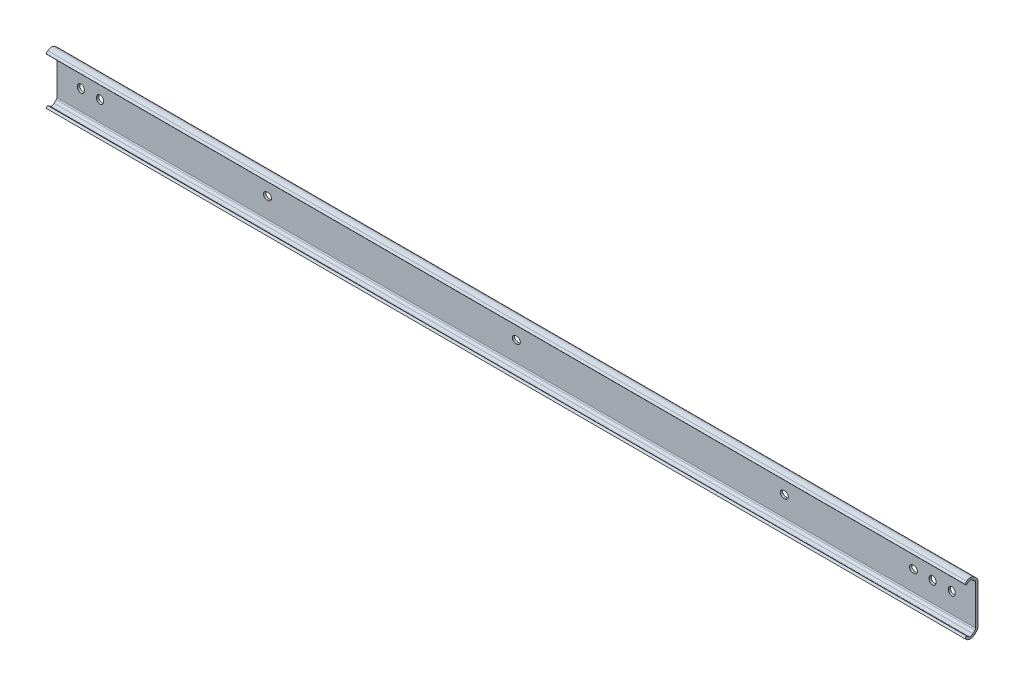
ISO-10303-21;
HEADER;
FILE_DESCRIPTION(('STEP AP214'),'2;1');
FILE_NAME('part.step','',(''),(''),'','','');
FILE_SCHEMA(('AUTOMOTIVE_DESIGN { 1 0 10303 214 1 1 1 1 }'));
ENDSEC;
DATA;
#1=APPLICATION_CONTEXT('core data for automotive mechanical design processes');
#2=APPLICATION_PROTOCOL_DEFINITION('international standard','automotive_design',2000,#1);
#3=PRODUCT_CONTEXT('',#1,'mechanical');
#4=PRODUCT('Part','Part','',(#3));
#5=PRODUCT_RELATED_PRODUCT_CATEGORY('part','',(#4));
#6=PRODUCT_DEFINITION_FORMATION('','',#4);
#7=PRODUCT_DEFINITION_CONTEXT('part definition',#1,'design');
#8=PRODUCT_DEFINITION('design','',#6,#7);
#9=PRODUCT_DEFINITION_SHAPE('','',#8);
#10=(LENGTH_UNIT() NAMED_UNIT(*) SI_UNIT(.MILLI.,.METRE.));
#11=(NAMED_UNIT(*) PLANE_ANGLE_UNIT() SI_UNIT($,.RADIAN.));
#12=(NAMED_UNIT(*) SI_UNIT($,.STERADIAN.) SOLID_ANGLE_UNIT());
#13=UNCERTAINTY_MEASURE_WITH_UNIT(LENGTH_MEASURE(1.E-05),#10,'distance_accuracy_value','');
#14=(GEOMETRIC_REPRESENTATION_CONTEXT(3) GLOBAL_UNCERTAINTY_ASSIGNED_CONTEXT((#13)) GLOBAL_UNIT_ASSIGNED_CONTEXT((#10,
#11,#12)) REPRESENTATION_CONTEXT('',''));
#15=CARTESIAN_POINT('',(0.,0.,0.));
#16=DIRECTION('',(0.,0.,1.));
#17=DIRECTION('',(1.,0.,0.));
#18=AXIS2_PLACEMENT_3D('',#15,#16,#17);
#19=CARTESIAN_POINT('',(-15.9,13.1771270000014,1.52400011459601));
#20=DIRECTION('',(0.,0.,1.));
#21=DIRECTION('',(-1.,0.,0.));
#22=AXIS2_PLACEMENT_3D('',#19,#20,#21);
#23=PLANE('',#22);
#24=DIRECTION('',(0.,-1.,0.));
#25=VECTOR('',#24,1.);
#26=CARTESIAN_POINT('',(-15.9,13.1771270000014,1.52400011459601));
#27=LINE('',#26,#25);
#28=CARTESIAN_POINT('',(-15.9,13.1771270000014,1.52400011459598));
#29=VERTEX_POINT('',#28);
#30=CARTESIAN_POINT('',(-15.9,-13.1771270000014,1.52400011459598));
#31=VERTEX_POINT('',#30);
#32=EDGE_CURVE('E744',#29,#31,#27,.T.);
#33=ORIENTED_EDGE('',*,*,#32,.T.);
#34=DIRECTION('',(1.,0.,0.));
#35=VECTOR('',#34,1.);
#36=CARTESIAN_POINT('',(-15.9,-13.1771270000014,1.52400011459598));
#37=LINE('',#36,#35);
#38=CARTESIAN_POINT('',(593.7,-13.1771270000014,1.52400011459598));
#39=VERTEX_POINT('',#38);
#40=EDGE_CURVE('E372',#31,#39,#37,.T.);
#41=ORIENTED_EDGE('',*,*,#40,.T.);
#42=DIRECTION('',(0.,-1.,0.));
#43=VECTOR('',#42,1.);
#44=CARTESIAN_POINT('',(593.7,13.1771270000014,1.52400011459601));
#45=LINE('',#44,#43);
#46=CARTESIAN_POINT('',(593.7,13.1771270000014,1.52400011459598));
#47=VERTEX_POINT('',#46);
#48=EDGE_CURVE('E714',#47,#39,#45,.T.);
#49=ORIENTED_EDGE('',*,*,#48,.F.);
#50=DIRECTION('',(1.,0.,0.));
#51=VECTOR('',#50,1.);
#52=CARTESIAN_POINT('',(-15.9,13.1771270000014,1.52400011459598));
#53=LINE('',#52,#51);
#54=EDGE_CURVE('E9',#29,#47,#53,.T.);
#55=ORIENTED_EDGE('',*,*,#54,.F.);
#56=EDGE_LOOP('',(#33,#41,#49,#55));
#57=FACE_BOUND('',#56,.T.);
#58=CARTESIAN_POINT('',(124.2,0.,1.52400011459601));
#59=DIRECTION('',(0.,0.,1.));
#60=DIRECTION('',(-1.,0.,0.));
#61=AXIS2_PLACEMENT_3D('',#58,#59,#60);
#62=CIRCLE('',#61,2.25);
#63=CARTESIAN_POINT('',(124.2,-2.25,1.52400011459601));
#64=VERTEX_POINT('',#63);
#65=CARTESIAN_POINT('',(124.2,2.25,1.52400011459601));
#66=VERTEX_POINT('',#65);
#67=EDGE_CURVE('E31',#64,#66,#62,.T.);
#68=ORIENTED_EDGE('',*,*,#67,.F.);
#69=DIRECTION('',(1.,0.,0.));
#70=VECTOR('',#69,1.);
#71=CARTESIAN_POINT('',(123.4,-2.25,1.52400011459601));
#72=LINE('',#71,#70);
#73=CARTESIAN_POINT('',(123.4,-2.25,1.52400011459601));
#74=VERTEX_POINT('',#73);
#75=EDGE_CURVE('E449',#74,#64,#72,.T.);
#76=ORIENTED_EDGE('',*,*,#75,.F.);
#77=CARTESIAN_POINT('',(123.4,0.,1.52400011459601));
#78=DIRECTION('',(0.,0.,1.));
#79=DIRECTION('',(-1.,0.,0.));
#80=AXIS2_PLACEMENT_3D('',#77,#78,#79);
#81=CIRCLE('',#80,2.25);
#82=CARTESIAN_POINT('',(123.4,2.25,1.52400011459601));
#83=VERTEX_POINT('',#82);
#84=EDGE_CURVE('E446',#83,#74,#81,.T.);
#85=ORIENTED_EDGE('',*,*,#84,.F.);
#86=DIRECTION('',(-1.,0.,0.));
#87=VECTOR('',#86,1.);
#88=CARTESIAN_POINT('',(124.2,2.25,1.52400011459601));
#89=LINE('',#88,#87);
#90=EDGE_CURVE('E444',#66,#83,#89,.T.);
#91=ORIENTED_EDGE('',*,*,#90,.F.);
#92=EDGE_LOOP('',(#68,#76,#85,#91));
#93=FACE_BOUND('',#92,.T.);
#94=CARTESIAN_POINT('',(289.3,0.,1.52400011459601));
#95=DIRECTION('',(0.,0.,1.));
#96=DIRECTION('',(-1.,0.,0.));
#97=AXIS2_PLACEMENT_3D('',#94,#95,#96);
#98=CIRCLE('',#97,2.25);
#99=CARTESIAN_POINT('',(289.3,-2.25,1.52400011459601));
#100=VERTEX_POINT('',#99);
#101=CARTESIAN_POINT('',(289.3,2.25,1.52400011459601));
#102=VERTEX_POINT('',#101);
#103=EDGE_CURVE('E471',#100,#102,#98,.T.);
#104=ORIENTED_EDGE('',*,*,#103,.F.);
#105=DIRECTION('',(1.,0.,0.));
#106=VECTOR('',#105,1.);
#107=CARTESIAN_POINT('',(288.5,-2.25,1.52400011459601));
#108=LINE('',#107,#106);
#109=CARTESIAN_POINT('',(288.5,-2.25,1.52400011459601));
#110=VERTEX_POINT('',#109);
#111=EDGE_CURVE('E479',#110,#100,#108,.T.);
#112=ORIENTED_EDGE('',*,*,#111,.F.);
#113=CARTESIAN_POINT('',(288.5,0.,1.52400011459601));
#114=DIRECTION('',(0.,0.,1.));
#115=DIRECTION('',(-1.,0.,0.));
#116=AXIS2_PLACEMENT_3D('',#113,#114,#115);
#117=CIRCLE('',#116,2.25);
#118=CARTESIAN_POINT('',(288.5,2.25,1.52400011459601));
#119=VERTEX_POINT('',#118);
#120=EDGE_CURVE('E476',#119,#110,#117,.T.);
#121=ORIENTED_EDGE('',*,*,#120,.F.);
#122=DIRECTION('',(-1.,0.,0.));
#123=VECTOR('',#122,1.);
#124=CARTESIAN_POINT('',(289.3,2.25,1.52400011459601));
#125=LINE('',#124,#123);
#126=EDGE_CURVE('E473',#102,#119,#125,.T.);
#127=ORIENTED_EDGE('',*,*,#126,.F.);
#128=EDGE_LOOP('',(#104,#112,#121,#127));
#129=FACE_BOUND('',#128,.T.);
#130=CARTESIAN_POINT('',(467.1,0.,1.52400011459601));
#131=DIRECTION('',(0.,0.,1.));
#132=DIRECTION('',(-1.,0.,0.));
#133=AXIS2_PLACEMENT_3D('',#130,#131,#132);
#134=CIRCLE('',#133,2.25);
#135=CARTESIAN_POINT('',(467.1,-2.25,1.52400011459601));
#136=VERTEX_POINT('',#135);
#137=CARTESIAN_POINT('',(467.1,2.25,1.52400011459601));
#138=VERTEX_POINT('',#137);
#139=EDGE_CURVE('E503',#136,#138,#134,.T.);
#140=ORIENTED_EDGE('',*,*,#139,.F.);
#141=DIRECTION('',(1.,0.,0.));
#142=VECTOR('',#141,1.);
#143=CARTESIAN_POINT('',(466.3,-2.25,1.52400011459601));
#144=LINE('',#143,#142);
#145=CARTESIAN_POINT('',(466.3,-2.25,1.52400011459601));
#146=VERTEX_POINT('',#145);
#147=EDGE_CURVE('E511',#146,#136,#144,.T.);
#148=ORIENTED_EDGE('',*,*,#147,.F.);
#149=CARTESIAN_POINT('',(466.3,0.,1.52400011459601));
#150=DIRECTION('',(0.,0.,1.));
#151=DIRECTION('',(-1.,0.,0.));
#152=AXIS2_PLACEMENT_3D('',#149,#150,#151);
#153=CIRCLE('',#152,2.25);
#154=CARTESIAN_POINT('',(466.3,2.25,1.52400011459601));
#155=VERTEX_POINT('',#154);
#156=EDGE_CURVE('E508',#155,#146,#153,.T.);
#157=ORIENTED_EDGE('',*,*,#156,.F.);
#158=DIRECTION('',(-1.,0.,0.));
#159=VECTOR('',#158,1.);
#160=CARTESIAN_POINT('',(467.1,2.25,1.52400011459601));
#161=LINE('',#160,#159);
#162=EDGE_CURVE('E505',#138,#155,#161,.T.);
#163=ORIENTED_EDGE('',*,*,#162,.F.);
#164=EDGE_LOOP('',(#140,#148,#157,#163));
#165=FACE_BOUND('',#164,.T.);
#166=CARTESIAN_POINT('',(0.,-0.4,1.52400011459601));
#167=DIRECTION('',(0.,0.,1.));
#168=DIRECTION('',(-1.,0.,0.));
#169=AXIS2_PLACEMENT_3D('',#166,#167,#168);
#170=CIRCLE('',#169,2.24999999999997);
#171=CARTESIAN_POINT('',(-2.24999999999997,-0.4,1.52400011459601));
#172=VERTEX_POINT('',#171);
#173=CARTESIAN_POINT('',(2.24999999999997,-0.4,1.52400011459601));
#174=VERTEX_POINT('',#173);
#175=EDGE_CURVE('E535',#172,#174,#170,.T.);
#176=ORIENTED_EDGE('',*,*,#175,.F.);
#177=DIRECTION('',(0.,-1.,0.));
#178=VECTOR('',#177,1.);
#179=CARTESIAN_POINT('',(-2.24999999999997,-0.4,1.52400011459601));
#180=LINE('',#179,#178);
#181=CARTESIAN_POINT('',(-2.24999999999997,0.4,1.52400011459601));
#182=VERTEX_POINT('',#181);
#183=EDGE_CURVE('E543',#182,#172,#180,.T.);
#184=ORIENTED_EDGE('',*,*,#183,.F.);
#185=CARTESIAN_POINT('',(0.,0.4,1.52400011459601));
#186=DIRECTION('',(0.,0.,1.));
#187=DIRECTION('',(-1.,0.,0.));
#188=AXIS2_PLACEMENT_3D('',#185,#186,#187);
#189=CIRCLE('',#188,2.24999999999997);
#190=CARTESIAN_POINT('',(2.24999999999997,0.4,1.52400011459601));
#191=VERTEX_POINT('',#190);
#192=EDGE_CURVE('E540',#191,#182,#189,.T.);
#193=ORIENTED_EDGE('',*,*,#192,.F.);
#194=DIRECTION('',(0.,1.,0.));
#195=VECTOR('',#194,1.);
#196=CARTESIAN_POINT('',(2.24999999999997,0.4,1.52400011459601));
#197=LINE('',#196,#195);
#198=EDGE_CURVE('E537',#174,#191,#197,.T.);
#199=ORIENTED_EDGE('',*,*,#198,.F.);
#200=EDGE_LOOP('',(#176,#184,#193,#199));
#201=FACE_BOUND('',#200,.T.);
#202=CARTESIAN_POINT('',(12.7,-0.4,1.52400011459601));
#203=DIRECTION('',(0.,0.,1.));
#204=DIRECTION('',(-1.,0.,0.));
#205=AXIS2_PLACEMENT_3D('',#202,#203,#204);
#206=CIRCLE('',#205,2.24999999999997);
#207=CARTESIAN_POINT('',(10.45,-0.4,1.52400011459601));
#208=VERTEX_POINT('',#207);
#209=CARTESIAN_POINT('',(14.95,-0.4,1.52400011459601));
#210=VERTEX_POINT('',#209);
#211=EDGE_CURVE('E567',#208,#210,#206,.T.);
#212=ORIENTED_EDGE('',*,*,#211,.F.);
#213=DIRECTION('',(0.,-1.,0.));
#214=VECTOR('',#213,1.);
#215=CARTESIAN_POINT('',(10.45,-0.4,1.52400011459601));
#216=LINE('',#215,#214);
#217=CARTESIAN_POINT('',(10.45,0.4,1.52400011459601));
#218=VERTEX_POINT('',#217);
#219=EDGE_CURVE('E575',#218,#208,#216,.T.);
#220=ORIENTED_EDGE('',*,*,#219,.F.);
#221=CARTESIAN_POINT('',(12.7,0.4,1.52400011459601));
#222=DIRECTION('',(0.,0.,1.));
#223=DIRECTION('',(-1.,0.,0.));
#224=AXIS2_PLACEMENT_3D('',#221,#222,#223);
#225=CIRCLE('',#224,2.24999999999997);
#226=CARTESIAN_POINT('',(14.95,0.4,1.52400011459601));
#227=VERTEX_POINT('',#226);
#228=EDGE_CURVE('E572',#227,#218,#225,.T.);
#229=ORIENTED_EDGE('',*,*,#228,.F.);
#230=DIRECTION('',(0.,1.,0.));
#231=VECTOR('',#230,1.);
#232=CARTESIAN_POINT('',(14.95,0.4,1.52400011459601));
#233=LINE('',#232,#231);
#234=EDGE_CURVE('E569',#210,#227,#233,.T.);
#235=ORIENTED_EDGE('',*,*,#234,.F.);
#236=EDGE_LOOP('',(#212,#220,#229,#235));
#237=FACE_BOUND('',#236,.T.);
#238=CARTESIAN_POINT('',(565.1,-0.4,1.52400011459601));
#239=DIRECTION('',(0.,0.,1.));
#240=DIRECTION('',(-1.,0.,0.));
#241=AXIS2_PLACEMENT_3D('',#238,#239,#240);
#242=CIRCLE('',#241,2.25);
#243=CARTESIAN_POINT('',(562.85,-0.4,1.52400011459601));
#244=VERTEX_POINT('',#243);
#245=CARTESIAN_POINT('',(567.35,-0.4,1.52400011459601));
#246=VERTEX_POINT('',#245);
#247=EDGE_CURVE('E599',#244,#246,#242,.T.);
#248=ORIENTED_EDGE('',*,*,#247,.F.);
#249=DIRECTION('',(0.,-1.,0.));
#250=VECTOR('',#249,1.);
#251=CARTESIAN_POINT('',(562.85,-0.4,1.52400011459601));
#252=LINE('',#251,#250);
#253=CARTESIAN_POINT('',(562.85,0.4,1.52400011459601));
#254=VERTEX_POINT('',#253);
#255=EDGE_CURVE('E607',#254,#244,#252,.T.);
#256=ORIENTED_EDGE('',*,*,#255,.F.);
#257=CARTESIAN_POINT('',(565.1,0.4,1.52400011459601));
#258=DIRECTION('',(0.,0.,1.));
#259=DIRECTION('',(-1.,0.,0.));
#260=AXIS2_PLACEMENT_3D('',#257,#258,#259);
#261=CIRCLE('',#260,2.25);
#262=CARTESIAN_POINT('',(567.35,0.4,1.52400011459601));
#263=VERTEX_POINT('',#262);
#264=EDGE_CURVE('E604',#263,#254,#261,.T.);
#265=ORIENTED_EDGE('',*,*,#264,.F.);
#266=DIRECTION('',(0.,1.,0.));
#267=VECTOR('',#266,1.);
#268=CARTESIAN_POINT('',(567.35,0.4,1.52400011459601));
#269=LINE('',#268,#267);
#270=EDGE_CURVE('E601',#246,#263,#269,.T.);
#271=ORIENTED_EDGE('',*,*,#270,.F.);
#272=EDGE_LOOP('',(#248,#256,#265,#271));
#273=FACE_BOUND('',#272,.T.);
#274=CARTESIAN_POINT('',(552.8,0.,1.52400011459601));
#275=DIRECTION('',(0.,0.,1.));
#276=DIRECTION('',(-1.,0.,0.));
#277=AXIS2_PLACEMENT_3D('',#274,#275,#276);
#278=CIRCLE('',#277,2.25);
#279=CARTESIAN_POINT('',(552.8,-2.25,1.52400011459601));
#280=VERTEX_POINT('',#279);
#281=CARTESIAN_POINT('',(552.8,2.25,1.52400011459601));
#282=VERTEX_POINT('',#281);
#283=EDGE_CURVE('E631',#280,#282,#278,.T.);
#284=ORIENTED_EDGE('',*,*,#283,.F.);
#285=DIRECTION('',(1.,0.,0.));
#286=VECTOR('',#285,1.);
#287=CARTESIAN_POINT('',(552.,-2.25,1.52400011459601));
#288=LINE('',#287,#286);
#289=CARTESIAN_POINT('',(552.,-2.25,1.52400011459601));
#290=VERTEX_POINT('',#289);
#291=EDGE_CURVE('E639',#290,#280,#288,.T.);
#292=ORIENTED_EDGE('',*,*,#291,.F.);
#293=CARTESIAN_POINT('',(552.,0.,1.52400011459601));
#294=DIRECTION('',(0.,0.,1.));
#295=DIRECTION('',(-1.,0.,0.));
#296=AXIS2_PLACEMENT_3D('',#293,#294,#295);
#297=CIRCLE('',#296,2.25);
#298=CARTESIAN_POINT('',(552.,2.25,1.52400011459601));
#299=VERTEX_POINT('',#298);
#300=EDGE_CURVE('E636',#299,#290,#297,.T.);
#301=ORIENTED_EDGE('',*,*,#300,.F.);
#302=DIRECTION('',(-1.,0.,0.));
#303=VECTOR('',#302,1.);
#304=CARTESIAN_POINT('',(552.8,2.25,1.52400011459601));
#305=LINE('',#304,#303);
#306=EDGE_CURVE('E633',#282,#299,#305,.T.);
#307=ORIENTED_EDGE('',*,*,#306,.F.);
#308=EDGE_LOOP('',(#284,#292,#301,#307));
#309=FACE_BOUND('',#308,.T.);
#310=CARTESIAN_POINT('',(577.8,-0.4,1.52400011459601));
#311=DIRECTION('',(0.,0.,1.));
#312=DIRECTION('',(-1.,0.,0.));
#313=AXIS2_PLACEMENT_3D('',#310,#311,#312);
#314=CIRCLE('',#313,2.25);
#315=CARTESIAN_POINT('',(575.55,-0.4,1.52400011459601));
#316=VERTEX_POINT('',#315);
#317=CARTESIAN_POINT('',(580.05,-0.4,1.52400011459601));
#318=VERTEX_POINT('',#317);
#319=EDGE_CURVE('E663',#316,#318,#314,.T.);
#320=ORIENTED_EDGE('',*,*,#319,.F.);
#321=DIRECTION('',(0.,-1.,0.));
#322=VECTOR('',#321,1.);
#323=CARTESIAN_POINT('',(575.55,-0.4,1.52400011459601));
#324=LINE('',#323,#322);
#325=CARTESIAN_POINT('',(575.55,0.4,1.52400011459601));
#326=VERTEX_POINT('',#325);
#327=EDGE_CURVE('E671',#326,#316,#324,.T.);
#328=ORIENTED_EDGE('',*,*,#327,.F.);
#329=CARTESIAN_POINT('',(577.8,0.4,1.52400011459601));
#330=DIRECTION('',(0.,0.,1.));
#331=DIRECTION('',(-1.,0.,0.));
#332=AXIS2_PLACEMENT_3D('',#329,#330,#331);
#333=CIRCLE('',#332,2.25);
#334=CARTESIAN_POINT('',(580.05,0.4,1.52400011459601));
#335=VERTEX_POINT('',#334);
#336=EDGE_CURVE('E668',#335,#326,#333,.T.);
#337=ORIENTED_EDGE('',*,*,#336,.F.);
#338=DIRECTION('',(0.,1.,0.));
#339=VECTOR('',#338,1.);
#340=CARTESIAN_POINT('',(580.05,0.4,1.52400011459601));
#341=LINE('',#340,#339);
#342=EDGE_CURVE('E665',#318,#335,#341,.T.);
#343=ORIENTED_EDGE('',*,*,#342,.F.);
#344=EDGE_LOOP('',(#320,#328,#337,#343));
#345=FACE_BOUND('',#344,.T.);
#346=ADVANCED_FACE('F14',(#57,#93,#129,#165,#201,#237,#273,#309,#345),#23,.T.);
#347=CARTESIAN_POINT('',(-15.9,13.1771270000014,2.82399974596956));
#348=DIRECTION('',(1.,0.,0.));
#349=DIRECTION('',(0.,0.,1.));
#350=AXIS2_PLACEMENT_3D('',#347,#348,#349);
#351=CYLINDRICAL_SURFACE('',#350,1.29999963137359);
#352=CARTESIAN_POINT('',(593.7,13.1771270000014,2.82399974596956));
#353=DIRECTION('',(-1.,0.,0.));
#354=DIRECTION('',(0.,0.,-1.));
#355=AXIS2_PLACEMENT_3D('',#352,#353,#354);
#356=CIRCLE('',#355,1.29999963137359);
#357=CARTESIAN_POINT('',(593.7,14.1308812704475,1.94062449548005));
#358=VERTEX_POINT('',#357);
#359=EDGE_CURVE('E711',#358,#47,#356,.T.);
#360=ORIENTED_EDGE('',*,*,#359,.F.);
#361=DIRECTION('',(1.,0.,0.));
#362=VECTOR('',#361,1.);
#363=CARTESIAN_POINT('',(-15.9,14.1308812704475,1.94062449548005));
#364=LINE('',#363,#362);
#365=CARTESIAN_POINT('',(-15.9,14.1308812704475,1.94062449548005));
#366=VERTEX_POINT('',#365);
#367=EDGE_CURVE('E23',#366,#358,#364,.T.);
#368=ORIENTED_EDGE('',*,*,#367,.F.);
#369=CARTESIAN_POINT('',(-15.9,13.1771270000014,2.82399974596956));
#370=DIRECTION('',(-1.,0.,0.));
#371=DIRECTION('',(0.,0.,-1.));
#372=AXIS2_PLACEMENT_3D('',#369,#370,#371);
#373=CIRCLE('',#372,1.29999963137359);
#374=EDGE_CURVE('E741',#366,#29,#373,.T.);
#375=ORIENTED_EDGE('',*,*,#374,.T.);
#376=ORIENTED_EDGE('',*,*,#54,.T.);
#377=EDGE_LOOP('',(#360,#368,#375,#376));
#378=FACE_BOUND('',#377,.T.);
#379=ADVANCED_FACE('F804',(#378),#351,.F.);
#380=CARTESIAN_POINT('',(-15.9,15.4973237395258,3.41593142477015));
#381=DIRECTION('',(0.,-0.733657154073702,0.679519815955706));
#382=DIRECTION('',(0.,-0.679519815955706,-0.733657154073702));
#383=AXIS2_PLACEMENT_3D('',#380,#381,#382);
#384=PLANE('',#383);
#385=DIRECTION('',(0.,-0.679519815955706,-0.733657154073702));
#386=VECTOR('',#385,1.);
#387=CARTESIAN_POINT('',(593.7,15.4973237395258,3.41593142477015));
#388=LINE('',#387,#386);
#389=CARTESIAN_POINT('',(593.7,15.4973237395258,3.41593142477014));
#390=VERTEX_POINT('',#389);
#391=EDGE_CURVE('E708',#390,#358,#388,.T.);
#392=ORIENTED_EDGE('',*,*,#391,.F.);
#393=DIRECTION('',(1.,0.,0.));
#394=VECTOR('',#393,1.);
#395=CARTESIAN_POINT('',(-15.9,15.4973237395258,3.41593142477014));
#396=LINE('',#395,#394);
#397=CARTESIAN_POINT('',(-15.9,15.4973237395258,3.41593142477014));
#398=VERTEX_POINT('',#397);
#399=EDGE_CURVE('E747',#398,#390,#396,.T.);
#400=ORIENTED_EDGE('',*,*,#399,.F.);
#401=DIRECTION('',(0.,-0.679519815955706,-0.733657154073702));
#402=VECTOR('',#401,1.);
#403=CARTESIAN_POINT('',(-15.9,15.4973237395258,3.41593142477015));
#404=LINE('',#403,#402);
#405=EDGE_CURVE('E738',#398,#366,#404,.T.);
#406=ORIENTED_EDGE('',*,*,#405,.T.);
#407=ORIENTED_EDGE('',*,*,#367,.T.);
#408=EDGE_LOOP('',(#392,#400,#406,#407));
#409=FACE_BOUND('',#408,.T.);
#410=ADVANCED_FACE('F807',(#409),#384,.T.);
#411=CARTESIAN_POINT('',(-15.9,13.745000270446,5.04999949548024));
#412=DIRECTION('',(1.,0.,0.));
#413=DIRECTION('',(0.,0.,1.));
#414=AXIS2_PLACEMENT_3D('',#411,#412,#413);
#415=CYLINDRICAL_SURFACE('',#414,2.39600000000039);
#416=CARTESIAN_POINT('',(593.7,13.745000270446,5.04999949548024));
#417=DIRECTION('',(-1.,0.,0.));
#418=DIRECTION('',(0.,0.,-1.));
#419=AXIS2_PLACEMENT_3D('',#416,#417,#418);
#420=CIRCLE('',#419,2.39600000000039);
#421=CARTESIAN_POINT('',(593.7,15.4018251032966,6.78082226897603));
#422=VERTEX_POINT('',#421);
#423=EDGE_CURVE('E705',#422,#390,#420,.T.);
#424=ORIENTED_EDGE('',*,*,#423,.F.);
#425=DIRECTION('',(1.,0.,0.));
#426=VECTOR('',#425,1.);
#427=CARTESIAN_POINT('',(-15.9,15.4018251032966,6.78082226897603));
#428=LINE('',#427,#426);
#429=CARTESIAN_POINT('',(-15.9,15.4018251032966,6.78082226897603));
#430=VERTEX_POINT('',#429);
#431=EDGE_CURVE('E749',#430,#422,#428,.T.);
#432=ORIENTED_EDGE('',*,*,#431,.F.);
#433=CARTESIAN_POINT('',(-15.9,13.745000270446,5.04999949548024));
#434=DIRECTION('',(-1.,0.,0.));
#435=DIRECTION('',(0.,0.,-1.));
#436=AXIS2_PLACEMENT_3D('',#433,#434,#435);
#437=CIRCLE('',#436,2.39600000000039);
#438=EDGE_CURVE('E735',#430,#398,#437,.T.);
#439=ORIENTED_EDGE('',*,*,#438,.T.);
#440=ORIENTED_EDGE('',*,*,#399,.T.);
#441=EDGE_LOOP('',(#424,#432,#439,#440));
#442=FACE_BOUND('',#441,.T.);
#443=ADVANCED_FACE('F812',(#442),#415,.F.);
#444=CARTESIAN_POINT('',(-15.9,15.4018251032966,6.78082226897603));
#445=DIRECTION('',(0.,-0.741021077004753,-0.671481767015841));
#446=DIRECTION('',(0.,0.671481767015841,-0.741021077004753));
#447=AXIS2_PLACEMENT_3D('',#444,#445,#446);
#448=PLANE('',#447);
#449=DIRECTION('',(0.,0.671481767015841,-0.741021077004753));
#450=VECTOR('',#449,1.);
#451=CARTESIAN_POINT('',(593.7,15.4018251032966,6.78082226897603));
#452=LINE('',#451,#450);
#453=CARTESIAN_POINT('',(593.7,14.5356842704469,7.73666149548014));
#454=VERTEX_POINT('',#453);
#455=EDGE_CURVE('E702',#454,#422,#452,.T.);
#456=ORIENTED_EDGE('',*,*,#455,.F.);
#457=DIRECTION('',(1.,0.,0.));
#458=VECTOR('',#457,1.);
#459=CARTESIAN_POINT('',(-15.9,14.5356842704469,7.73666149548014));
#460=LINE('',#459,#458);
#461=CARTESIAN_POINT('',(-15.9,14.5356842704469,7.73666149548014));
#462=VERTEX_POINT('',#461);
#463=EDGE_CURVE('E751',#462,#454,#460,.T.);
#464=ORIENTED_EDGE('',*,*,#463,.F.);
#465=DIRECTION('',(0.,0.671481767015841,-0.741021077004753));
#466=VECTOR('',#465,1.);
#467=CARTESIAN_POINT('',(-15.9,15.4018251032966,6.78082226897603));
#468=LINE('',#467,#466);
#469=EDGE_CURVE('E732',#462,#430,#468,.T.);
#470=ORIENTED_EDGE('',*,*,#469,.T.);
#471=ORIENTED_EDGE('',*,*,#431,.T.);
#472=EDGE_LOOP('',(#456,#464,#470,#471));
#473=FACE_BOUND('',#472,.T.);
#474=ADVANCED_FACE('F815',(#473),#448,.T.);
#475=CARTESIAN_POINT('',(-15.9,14.5356842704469,7.73666149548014));
#476=DIRECTION('',(0.,-0.671481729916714,0.741021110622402));
#477=DIRECTION('',(0.,-0.741021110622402,-0.671481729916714));
#478=AXIS2_PLACEMENT_3D('',#475,#476,#477);
#479=PLANE('',#478);
#480=DIRECTION('',(0.,-0.741021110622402,-0.671481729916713));
#481=VECTOR('',#480,1.);
#482=CARTESIAN_POINT('',(593.7,14.5356842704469,7.73666149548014));
#483=LINE('',#482,#481);
#484=CARTESIAN_POINT('',(593.7,15.6649899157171,8.75999011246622));
#485=VERTEX_POINT('',#484);
#486=EDGE_CURVE('E699',#485,#454,#483,.T.);
#487=ORIENTED_EDGE('',*,*,#486,.F.);
#488=DIRECTION('',(1.,0.,0.));
#489=VECTOR('',#488,1.);
#490=CARTESIAN_POINT('',(-15.9,15.6649899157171,8.75999011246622));
#491=LINE('',#490,#489);
#492=CARTESIAN_POINT('',(-15.9,15.6649899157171,8.75999011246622));
#493=VERTEX_POINT('',#492);
#494=EDGE_CURVE('E753',#493,#485,#491,.T.);
#495=ORIENTED_EDGE('',*,*,#494,.F.);
#496=DIRECTION('',(0.,-0.741021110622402,-0.671481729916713));
#497=VECTOR('',#496,1.);
#498=CARTESIAN_POINT('',(-15.9,14.5356842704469,7.73666149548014));
#499=LINE('',#498,#497);
#500=EDGE_CURVE('E729',#493,#462,#499,.T.);
#501=ORIENTED_EDGE('',*,*,#500,.T.);
#502=ORIENTED_EDGE('',*,*,#463,.T.);
#503=EDGE_LOOP('',(#487,#495,#501,#502));
#504=FACE_BOUND('',#503,.T.);
#505=ADVANCED_FACE('F820',(#504),#479,.T.);
#506=CARTESIAN_POINT('',(-15.9,16.7914015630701,7.51692662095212));
#507=DIRECTION('',(0.,0.741020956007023,0.671481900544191));
#508=DIRECTION('',(0.,-0.671481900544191,0.741020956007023));
#509=AXIS2_PLACEMENT_3D('',#506,#507,#508);
#510=PLANE('',#509);
#511=DIRECTION('',(0.,-0.671481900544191,0.741020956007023));
#512=VECTOR('',#511,1.);
#513=CARTESIAN_POINT('',(593.7,16.7914015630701,7.51692662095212));
#514=LINE('',#513,#512);
#515=CARTESIAN_POINT('',(593.7,16.7914015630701,7.5169266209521));
#516=VERTEX_POINT('',#515);
#517=EDGE_CURVE('E696',#516,#485,#514,.T.);
#518=ORIENTED_EDGE('',*,*,#517,.F.);
#519=DIRECTION('',(1.,0.,0.));
#520=VECTOR('',#519,1.);
#521=CARTESIAN_POINT('',(-15.9,16.7914015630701,7.5169266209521));
#522=LINE('',#521,#520);
#523=CARTESIAN_POINT('',(-15.9,16.7914015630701,7.5169266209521));
#524=VERTEX_POINT('',#523);
#525=EDGE_CURVE('E755',#524,#516,#522,.T.);
#526=ORIENTED_EDGE('',*,*,#525,.F.);
#527=DIRECTION('',(0.,-0.671481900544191,0.741020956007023));
#528=VECTOR('',#527,1.);
#529=CARTESIAN_POINT('',(-15.9,16.7914015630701,7.51692662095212));
#530=LINE('',#529,#528);
#531=EDGE_CURVE('E726',#524,#493,#530,.T.);
#532=ORIENTED_EDGE('',*,*,#531,.T.);
#533=ORIENTED_EDGE('',*,*,#494,.T.);
#534=EDGE_LOOP('',(#518,#526,#532,#533));
#535=FACE_BOUND('',#534,.T.);
#536=ADVANCED_FACE('F823',(#535),#510,.T.);
#537=CARTESIAN_POINT('',(-15.9,13.745000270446,5.04999949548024));
#538=DIRECTION('',(1.,0.,0.));
#539=DIRECTION('',(0.,0.,1.));
#540=AXIS2_PLACEMENT_3D('',#537,#538,#539);
#541=CYLINDRICAL_SURFACE('',#540,3.91998600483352);
#542=CARTESIAN_POINT('',(593.7,13.745000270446,5.04999949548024));
#543=DIRECTION('',(1.,0.,0.));
#544=DIRECTION('',(0.,0.,-1.));
#545=AXIS2_PLACEMENT_3D('',#542,#543,#544);
#546=CIRCLE('',#545,3.91998600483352);
#547=CARTESIAN_POINT('',(593.7,16.620926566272,2.38629188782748));
#548=VERTEX_POINT('',#547);
#549=EDGE_CURVE('E693',#548,#516,#546,.T.);
#550=ORIENTED_EDGE('',*,*,#549,.F.);
#551=DIRECTION('',(1.,0.,0.));
#552=VECTOR('',#551,1.);
#553=CARTESIAN_POINT('',(-15.9,16.620926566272,2.38629188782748));
#554=LINE('',#553,#552);
#555=CARTESIAN_POINT('',(-15.9,16.620926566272,2.38629188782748));
#556=VERTEX_POINT('',#555);
#557=EDGE_CURVE('E757',#556,#548,#554,.T.);
#558=ORIENTED_EDGE('',*,*,#557,.F.);
#559=CARTESIAN_POINT('',(-15.9,13.745000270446,5.04999949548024));
#560=DIRECTION('',(1.,0.,0.));
#561=DIRECTION('',(0.,0.,-1.));
#562=AXIS2_PLACEMENT_3D('',#559,#560,#561);
#563=CIRCLE('',#562,3.91998600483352);
#564=EDGE_CURVE('E723',#556,#524,#563,.T.);
#565=ORIENTED_EDGE('',*,*,#564,.T.);
#566=ORIENTED_EDGE('',*,*,#525,.T.);
#567=EDGE_LOOP('',(#550,#558,#565,#566));
#568=FACE_BOUND('',#567,.T.);
#569=ADVANCED_FACE('F829',(#568),#541,.T.);
#570=CARTESIAN_POINT('',(-15.9,16.620926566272,2.38629188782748));
#571=DIRECTION('',(0.,0.73365728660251,-0.679519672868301));
#572=DIRECTION('',(0.,0.679519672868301,0.73365728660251));
#573=AXIS2_PLACEMENT_3D('',#570,#571,#572);
#574=PLANE('',#573);
#575=DIRECTION('',(0.,0.679519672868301,0.73365728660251));
#576=VECTOR('',#575,1.);
#577=CARTESIAN_POINT('',(593.7,16.620926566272,2.38629188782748));
#578=LINE('',#577,#576);
#579=CARTESIAN_POINT('',(593.7,15.2489749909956,0.90503636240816));
#580=VERTEX_POINT('',#579);
#581=EDGE_CURVE('E691',#580,#548,#578,.T.);
#582=ORIENTED_EDGE('',*,*,#581,.F.);
#583=DIRECTION('',(1.,0.,0.));
#584=VECTOR('',#583,1.);
#585=CARTESIAN_POINT('',(-15.9,15.2489749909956,0.90503636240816));
#586=LINE('',#585,#584);
#587=CARTESIAN_POINT('',(-15.9,15.2489749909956,0.90503636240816));
#588=VERTEX_POINT('',#587);
#589=EDGE_CURVE('E759',#588,#580,#586,.T.);
#590=ORIENTED_EDGE('',*,*,#589,.F.);
#591=DIRECTION('',(0.,0.679519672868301,0.73365728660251));
#592=VECTOR('',#591,1.);
#593=CARTESIAN_POINT('',(-15.9,16.620926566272,2.38629188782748));
#594=LINE('',#593,#592);
#595=EDGE_CURVE('E721',#588,#556,#594,.T.);
#596=ORIENTED_EDGE('',*,*,#595,.T.);
#597=ORIENTED_EDGE('',*,*,#557,.T.);
#598=EDGE_LOOP('',(#582,#590,#596,#597));
#599=FACE_BOUND('',#598,.T.);
#600=ADVANCED_FACE('F831',(#599),#574,.T.);
#601=CARTESIAN_POINT('',(-15.9,13.1771270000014,2.82399974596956));
#602=DIRECTION('',(1.,0.,0.));
#603=DIRECTION('',(0.,0.,1.));
#604=AXIS2_PLACEMENT_3D('',#601,#602,#603);
#605=CYLINDRICAL_SURFACE('',#604,2.82399974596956);
#606=CARTESIAN_POINT('',(593.7,13.1771270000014,2.82399974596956));
#607=DIRECTION('',(1.,0.,0.));
#608=DIRECTION('',(0.,0.,-1.));
#609=AXIS2_PLACEMENT_3D('',#606,#607,#608);
#610=CIRCLE('',#609,2.82399974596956);
#611=CARTESIAN_POINT('',(593.7,13.1771270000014,0.));
#612=VERTEX_POINT('',#611);
#613=EDGE_CURVE('E688',#612,#580,#610,.T.);
#614=ORIENTED_EDGE('',*,*,#613,.F.);
#615=DIRECTION('',(1.,0.,0.));
#616=VECTOR('',#615,1.);
#617=CARTESIAN_POINT('',(-15.9,13.1771270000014,0.));
#618=LINE('',#617,#616);
#619=CARTESIAN_POINT('',(-15.9,13.1771270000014,0.));
#620=VERTEX_POINT('',#619);
#621=EDGE_CURVE('E18',#620,#612,#618,.T.);
#622=ORIENTED_EDGE('',*,*,#621,.F.);
#623=CARTESIAN_POINT('',(-15.9,13.1771270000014,2.82399974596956));
#624=DIRECTION('',(1.,0.,0.));
#625=DIRECTION('',(0.,0.,-1.));
#626=AXIS2_PLACEMENT_3D('',#623,#624,#625);
#627=CIRCLE('',#626,2.82399974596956);
#628=EDGE_CURVE('E718',#620,#588,#627,.T.);
#629=ORIENTED_EDGE('',*,*,#628,.T.);
#630=ORIENTED_EDGE('',*,*,#589,.T.);
#631=EDGE_LOOP('',(#614,#622,#629,#630));
#632=FACE_BOUND('',#631,.T.);
#633=ADVANCED_FACE('F768',(#632),#605,.T.);
#634=CARTESIAN_POINT('',(-15.9,13.1771270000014,0.));
#635=DIRECTION('',(0.,0.,-1.));
#636=DIRECTION('',(1.,0.,0.));
#637=AXIS2_PLACEMENT_3D('',#634,#635,#636);
#638=PLANE('',#637);
#639=ORIENTED_EDGE('',*,*,#621,.T.);
#640=DIRECTION('',(0.,1.,0.));
#641=VECTOR('',#640,1.);
#642=CARTESIAN_POINT('',(593.7,13.1771270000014,0.));
#643=LINE('',#642,#641);
#644=CARTESIAN_POINT('',(593.7,-13.1771270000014,0.));
#645=VERTEX_POINT('',#644);
#646=EDGE_CURVE('E686',#645,#612,#643,.T.);
#647=ORIENTED_EDGE('',*,*,#646,.F.);
#648=DIRECTION('',(1.,0.,0.));
#649=VECTOR('',#648,1.);
#650=CARTESIAN_POINT('',(-15.9,-13.1771270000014,0.));
#651=LINE('',#650,#649);
#652=CARTESIAN_POINT('',(-15.9,-13.1771270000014,0.));
#653=VERTEX_POINT('',#652);
#654=EDGE_CURVE('E419',#653,#645,#651,.T.);
#655=ORIENTED_EDGE('',*,*,#654,.F.);
#656=DIRECTION('',(0.,1.,0.));
#657=VECTOR('',#656,1.);
#658=CARTESIAN_POINT('',(-15.9,13.1771270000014,0.));
#659=LINE('',#658,#657);
#660=EDGE_CURVE('E716',#653,#620,#659,.T.);
#661=ORIENTED_EDGE('',*,*,#660,.T.);
#662=EDGE_LOOP('',(#639,#647,#655,#661));
#663=FACE_BOUND('',#662,.T.);
#664=CARTESIAN_POINT('',(124.2,0.,0.));
#665=DIRECTION('',(0.,0.,-1.));
#666=DIRECTION('',(1.,0.,0.));
#667=AXIS2_PLACEMENT_3D('',#664,#665,#666);
#668=CIRCLE('',#667,2.25);
#669=CARTESIAN_POINT('',(124.2,-2.25,0.));
#670=VERTEX_POINT('',#669);
#671=CARTESIAN_POINT('',(124.2,2.25,0.));
#672=VERTEX_POINT('',#671);
#673=EDGE_CURVE('E440',#670,#672,#668,.F.);
#674=ORIENTED_EDGE('',*,*,#673,.T.);
#675=DIRECTION('',(-1.,0.,0.));
#676=VECTOR('',#675,1.);
#677=CARTESIAN_POINT('',(124.2,2.25,0.));
#678=LINE('',#677,#676);
#679=CARTESIAN_POINT('',(123.4,2.25,0.));
#680=VERTEX_POINT('',#679);
#681=EDGE_CURVE('E455',#672,#680,#678,.T.);
#682=ORIENTED_EDGE('',*,*,#681,.T.);
#683=CARTESIAN_POINT('',(123.4,0.,0.));
#684=DIRECTION('',(0.,0.,-1.));
#685=DIRECTION('',(1.,0.,0.));
#686=AXIS2_PLACEMENT_3D('',#683,#684,#685);
#687=CIRCLE('',#686,2.25);
#688=CARTESIAN_POINT('',(123.4,-2.25,0.));
#689=VERTEX_POINT('',#688);
#690=EDGE_CURVE('E418',#680,#689,#687,.F.);
#691=ORIENTED_EDGE('',*,*,#690,.T.);
#692=DIRECTION('',(1.,0.,0.));
#693=VECTOR('',#692,1.);
#694=CARTESIAN_POINT('',(123.4,-2.25,0.));
#695=LINE('',#694,#693);
#696=EDGE_CURVE('E437',#689,#670,#695,.T.);
#697=ORIENTED_EDGE('',*,*,#696,.T.);
#698=EDGE_LOOP('',(#674,#682,#691,#697));
#699=FACE_BOUND('',#698,.T.);
#700=CARTESIAN_POINT('',(289.3,0.,0.));
#701=DIRECTION('',(0.,0.,-1.));
#702=DIRECTION('',(1.,0.,0.));
#703=AXIS2_PLACEMENT_3D('',#700,#701,#702);
#704=CIRCLE('',#703,2.25);
#705=CARTESIAN_POINT('',(289.3,-2.25,0.));
#706=VERTEX_POINT('',#705);
#707=CARTESIAN_POINT('',(289.3,2.25,0.));
#708=VERTEX_POINT('',#707);
#709=EDGE_CURVE('E468',#706,#708,#704,.F.);
#710=ORIENTED_EDGE('',*,*,#709,.T.);
#711=DIRECTION('',(-1.,0.,0.));
#712=VECTOR('',#711,1.);
#713=CARTESIAN_POINT('',(289.3,2.25,0.));
#714=LINE('',#713,#712);
#715=CARTESIAN_POINT('',(288.5,2.25,0.));
#716=VERTEX_POINT('',#715);
#717=EDGE_CURVE('E485',#708,#716,#714,.T.);
#718=ORIENTED_EDGE('',*,*,#717,.T.);
#719=CARTESIAN_POINT('',(288.5,0.,0.));
#720=DIRECTION('',(0.,0.,-1.));
#721=DIRECTION('',(1.,0.,0.));
#722=AXIS2_PLACEMENT_3D('',#719,#720,#721);
#723=CIRCLE('',#722,2.25);
#724=CARTESIAN_POINT('',(288.5,-2.25,0.));
#725=VERTEX_POINT('',#724);
#726=EDGE_CURVE('E462',#716,#725,#723,.F.);
#727=ORIENTED_EDGE('',*,*,#726,.T.);
#728=DIRECTION('',(1.,0.,0.));
#729=VECTOR('',#728,1.);
#730=CARTESIAN_POINT('',(288.5,-2.25,0.));
#731=LINE('',#730,#729);
#732=EDGE_CURVE('E465',#725,#706,#731,.T.);
#733=ORIENTED_EDGE('',*,*,#732,.T.);
#734=EDGE_LOOP('',(#710,#718,#727,#733));
#735=FACE_BOUND('',#734,.T.);
#736=CARTESIAN_POINT('',(467.1,0.,0.));
#737=DIRECTION('',(0.,0.,-1.));
#738=DIRECTION('',(1.,0.,0.));
#739=AXIS2_PLACEMENT_3D('',#736,#737,#738);
#740=CIRCLE('',#739,2.25);
#741=CARTESIAN_POINT('',(467.1,-2.25,0.));
#742=VERTEX_POINT('',#741);
#743=CARTESIAN_POINT('',(467.1,2.25,0.));
#744=VERTEX_POINT('',#743);
#745=EDGE_CURVE('E500',#742,#744,#740,.F.);
#746=ORIENTED_EDGE('',*,*,#745,.T.);
#747=DIRECTION('',(-1.,0.,0.));
#748=VECTOR('',#747,1.);
#749=CARTESIAN_POINT('',(467.1,2.25,0.));
#750=LINE('',#749,#748);
#751=CARTESIAN_POINT('',(466.3,2.25,0.));
#752=VERTEX_POINT('',#751);
#753=EDGE_CURVE('E517',#744,#752,#750,.T.);
#754=ORIENTED_EDGE('',*,*,#753,.T.);
#755=CARTESIAN_POINT('',(466.3,0.,0.));
#756=DIRECTION('',(0.,0.,-1.));
#757=DIRECTION('',(1.,0.,0.));
#758=AXIS2_PLACEMENT_3D('',#755,#756,#757);
#759=CIRCLE('',#758,2.25);
#760=CARTESIAN_POINT('',(466.3,-2.25,0.));
#761=VERTEX_POINT('',#760);
#762=EDGE_CURVE('E494',#752,#761,#759,.F.);
#763=ORIENTED_EDGE('',*,*,#762,.T.);
#764=DIRECTION('',(1.,0.,0.));
#765=VECTOR('',#764,1.);
#766=CARTESIAN_POINT('',(466.3,-2.25,0.));
#767=LINE('',#766,#765);
#768=EDGE_CURVE('E497',#761,#742,#767,.T.);
#769=ORIENTED_EDGE('',*,*,#768,.T.);
#770=EDGE_LOOP('',(#746,#754,#763,#769));
#771=FACE_BOUND('',#770,.T.);
#772=CARTESIAN_POINT('',(0.,-0.4,0.));
#773=DIRECTION('',(0.,0.,-1.));
#774=DIRECTION('',(1.,0.,0.));
#775=AXIS2_PLACEMENT_3D('',#772,#773,#774);
#776=CIRCLE('',#775,2.24999999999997);
#777=CARTESIAN_POINT('',(-2.24999999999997,-0.4,0.));
#778=VERTEX_POINT('',#777);
#779=CARTESIAN_POINT('',(2.24999999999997,-0.4,0.));
#780=VERTEX_POINT('',#779);
#781=EDGE_CURVE('E532',#778,#780,#776,.F.);
#782=ORIENTED_EDGE('',*,*,#781,.T.);
#783=DIRECTION('',(0.,1.,0.));
#784=VECTOR('',#783,1.);
#785=CARTESIAN_POINT('',(2.24999999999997,0.4,0.));
#786=LINE('',#785,#784);
#787=CARTESIAN_POINT('',(2.24999999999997,0.4,0.));
#788=VERTEX_POINT('',#787);
#789=EDGE_CURVE('E549',#780,#788,#786,.T.);
#790=ORIENTED_EDGE('',*,*,#789,.T.);
#791=CARTESIAN_POINT('',(0.,0.4,0.));
#792=DIRECTION('',(0.,0.,-1.));
#793=DIRECTION('',(1.,0.,0.));
#794=AXIS2_PLACEMENT_3D('',#791,#792,#793);
#795=CIRCLE('',#794,2.24999999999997);
#796=CARTESIAN_POINT('',(-2.24999999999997,0.4,0.));
#797=VERTEX_POINT('',#796);
#798=EDGE_CURVE('E526',#788,#797,#795,.F.);
#799=ORIENTED_EDGE('',*,*,#798,.T.);
#800=DIRECTION('',(0.,-1.,0.));
#801=VECTOR('',#800,1.);
#802=CARTESIAN_POINT('',(-2.24999999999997,-0.4,0.));
#803=LINE('',#802,#801);
#804=EDGE_CURVE('E529',#797,#778,#803,.T.);
#805=ORIENTED_EDGE('',*,*,#804,.T.);
#806=EDGE_LOOP('',(#782,#790,#799,#805));
#807=FACE_BOUND('',#806,.T.);
#808=CARTESIAN_POINT('',(12.7,-0.4,0.));
#809=DIRECTION('',(0.,0.,-1.));
#810=DIRECTION('',(1.,0.,0.));
#811=AXIS2_PLACEMENT_3D('',#808,#809,#810);
#812=CIRCLE('',#811,2.24999999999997);
#813=CARTESIAN_POINT('',(10.45,-0.4,0.));
#814=VERTEX_POINT('',#813);
#815=CARTESIAN_POINT('',(14.95,-0.4,0.));
#816=VERTEX_POINT('',#815);
#817=EDGE_CURVE('E564',#814,#816,#812,.F.);
#818=ORIENTED_EDGE('',*,*,#817,.T.);
#819=DIRECTION('',(0.,1.,0.));
#820=VECTOR('',#819,1.);
#821=CARTESIAN_POINT('',(14.95,0.4,0.));
#822=LINE('',#821,#820);
#823=CARTESIAN_POINT('',(14.95,0.4,0.));
#824=VERTEX_POINT('',#823);
#825=EDGE_CURVE('E581',#816,#824,#822,.T.);
#826=ORIENTED_EDGE('',*,*,#825,.T.);
#827=CARTESIAN_POINT('',(12.7,0.4,0.));
#828=DIRECTION('',(0.,0.,-1.));
#829=DIRECTION('',(1.,0.,0.));
#830=AXIS2_PLACEMENT_3D('',#827,#828,#829);
#831=CIRCLE('',#830,2.24999999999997);
#832=CARTESIAN_POINT('',(10.45,0.4,0.));
#833=VERTEX_POINT('',#832);
#834=EDGE_CURVE('E558',#824,#833,#831,.F.);
#835=ORIENTED_EDGE('',*,*,#834,.T.);
#836=DIRECTION('',(0.,-1.,0.));
#837=VECTOR('',#836,1.);
#838=CARTESIAN_POINT('',(10.45,-0.4,0.));
#839=LINE('',#838,#837);
#840=EDGE_CURVE('E561',#833,#814,#839,.T.);
#841=ORIENTED_EDGE('',*,*,#840,.T.);
#842=EDGE_LOOP('',(#818,#826,#835,#841));
#843=FACE_BOUND('',#842,.T.);
#844=CARTESIAN_POINT('',(565.1,-0.4,0.));
#845=DIRECTION('',(0.,0.,-1.));
#846=DIRECTION('',(1.,0.,0.));
#847=AXIS2_PLACEMENT_3D('',#844,#845,#846);
#848=CIRCLE('',#847,2.25);
#849=CARTESIAN_POINT('',(562.85,-0.4,0.));
#850=VERTEX_POINT('',#849);
#851=CARTESIAN_POINT('',(567.35,-0.4,0.));
#852=VERTEX_POINT('',#851);
#853=EDGE_CURVE('E596',#850,#852,#848,.F.);
#854=ORIENTED_EDGE('',*,*,#853,.T.);
#855=DIRECTION('',(0.,1.,0.));
#856=VECTOR('',#855,1.);
#857=CARTESIAN_POINT('',(567.35,0.4,0.));
#858=LINE('',#857,#856);
#859=CARTESIAN_POINT('',(567.35,0.4,0.));
#860=VERTEX_POINT('',#859);
#861=EDGE_CURVE('E613',#852,#860,#858,.T.);
#862=ORIENTED_EDGE('',*,*,#861,.T.);
#863=CARTESIAN_POINT('',(565.1,0.4,0.));
#864=DIRECTION('',(0.,0.,-1.));
#865=DIRECTION('',(1.,0.,0.));
#866=AXIS2_PLACEMENT_3D('',#863,#864,#865);
#867=CIRCLE('',#866,2.25);
#868=CARTESIAN_POINT('',(562.85,0.4,0.));
#869=VERTEX_POINT('',#868);
#870=EDGE_CURVE('E590',#860,#869,#867,.F.);
#871=ORIENTED_EDGE('',*,*,#870,.T.);
#872=DIRECTION('',(0.,-1.,0.));
#873=VECTOR('',#872,1.);
#874=CARTESIAN_POINT('',(562.85,-0.4,0.));
#875=LINE('',#874,#873);
#876=EDGE_CURVE('E593',#869,#850,#875,.T.);
#877=ORIENTED_EDGE('',*,*,#876,.T.);
#878=EDGE_LOOP('',(#854,#862,#871,#877));
#879=FACE_BOUND('',#878,.T.);
#880=CARTESIAN_POINT('',(552.8,0.,0.));
#881=DIRECTION('',(0.,0.,-1.));
#882=DIRECTION('',(1.,0.,0.));
#883=AXIS2_PLACEMENT_3D('',#880,#881,#882);
#884=CIRCLE('',#883,2.25);
#885=CARTESIAN_POINT('',(552.8,-2.25,0.));
#886=VERTEX_POINT('',#885);
#887=CARTESIAN_POINT('',(552.8,2.25,0.));
#888=VERTEX_POINT('',#887);
#889=EDGE_CURVE('E628',#886,#888,#884,.F.);
#890=ORIENTED_EDGE('',*,*,#889,.T.);
#891=DIRECTION('',(-1.,0.,0.));
#892=VECTOR('',#891,1.);
#893=CARTESIAN_POINT('',(552.8,2.25,0.));
#894=LINE('',#893,#892);
#895=CARTESIAN_POINT('',(552.,2.25,0.));
#896=VERTEX_POINT('',#895);
#897=EDGE_CURVE('E645',#888,#896,#894,.T.);
#898=ORIENTED_EDGE('',*,*,#897,.T.);
#899=CARTESIAN_POINT('',(552.,0.,0.));
#900=DIRECTION('',(0.,0.,-1.));
#901=DIRECTION('',(1.,0.,0.));
#902=AXIS2_PLACEMENT_3D('',#899,#900,#901);
#903=CIRCLE('',#902,2.25);
#904=CARTESIAN_POINT('',(552.,-2.25,0.));
#905=VERTEX_POINT('',#904);
#906=EDGE_CURVE('E622',#896,#905,#903,.F.);
#907=ORIENTED_EDGE('',*,*,#906,.T.);
#908=DIRECTION('',(1.,0.,0.));
#909=VECTOR('',#908,1.);
#910=CARTESIAN_POINT('',(552.,-2.25,0.));
#911=LINE('',#910,#909);
#912=EDGE_CURVE('E625',#905,#886,#911,.T.);
#913=ORIENTED_EDGE('',*,*,#912,.T.);
#914=EDGE_LOOP('',(#890,#898,#907,#913));
#915=FACE_BOUND('',#914,.T.);
#916=CARTESIAN_POINT('',(577.8,-0.4,0.));
#917=DIRECTION('',(0.,0.,-1.));
#918=DIRECTION('',(1.,0.,0.));
#919=AXIS2_PLACEMENT_3D('',#916,#917,#918);
#920=CIRCLE('',#919,2.25);
#921=CARTESIAN_POINT('',(575.55,-0.4,0.));
#922=VERTEX_POINT('',#921);
#923=CARTESIAN_POINT('',(580.05,-0.4,0.));
#924=VERTEX_POINT('',#923);
#925=EDGE_CURVE('E660',#922,#924,#920,.F.);
#926=ORIENTED_EDGE('',*,*,#925,.T.);
#927=DIRECTION('',(0.,1.,0.));
#928=VECTOR('',#927,1.);
#929=CARTESIAN_POINT('',(580.05,0.4,0.));
#930=LINE('',#929,#928);
#931=CARTESIAN_POINT('',(580.05,0.4,0.));
#932=VERTEX_POINT('',#931);
#933=EDGE_CURVE('E677',#924,#932,#930,.T.);
#934=ORIENTED_EDGE('',*,*,#933,.T.);
#935=CARTESIAN_POINT('',(577.8,0.4,0.));
#936=DIRECTION('',(0.,0.,-1.));
#937=DIRECTION('',(1.,0.,0.));
#938=AXIS2_PLACEMENT_3D('',#935,#936,#937);
#939=CIRCLE('',#938,2.25);
#940=CARTESIAN_POINT('',(575.55,0.4,0.));
#941=VERTEX_POINT('',#940);
#942=EDGE_CURVE('E654',#932,#941,#939,.F.);
#943=ORIENTED_EDGE('',*,*,#942,.T.);
#944=DIRECTION('',(0.,-1.,0.));
#945=VECTOR('',#944,1.);
#946=CARTESIAN_POINT('',(575.55,-0.4,0.));
#947=LINE('',#946,#945);
#948=EDGE_CURVE('E657',#941,#922,#947,.T.);
#949=ORIENTED_EDGE('',*,*,#948,.T.);
#950=EDGE_LOOP('',(#926,#934,#943,#949));
#951=FACE_BOUND('',#950,.T.);
#952=ADVANCED_FACE('F16',(#663,#699,#735,#771,#807,#843,#879,#915,#951),#638,.T.);
#953=CARTESIAN_POINT('',(-15.9,-13.7450002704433,5.04999949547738));
#954=DIRECTION('',(1.,0.,0.));
#955=DIRECTION('',(0.,0.,1.));
#956=AXIS2_PLACEMENT_3D('',#953,#954,#955);
#957=PLANE('',#956);
#958=ORIENTED_EDGE('',*,*,#628,.F.);
#959=ORIENTED_EDGE('',*,*,#660,.F.);
#960=CARTESIAN_POINT('',(-15.9,-13.1771270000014,2.82399974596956));
#961=DIRECTION('',(1.,0.,0.));
#962=DIRECTION('',(0.,0.,-1.));
#963=AXIS2_PLACEMENT_3D('',#960,#961,#962);
#964=CIRCLE('',#963,2.82399974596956);
#965=CARTESIAN_POINT('',(-15.9,-15.2489749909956,0.905036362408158));
#966=VERTEX_POINT('',#965);
#967=EDGE_CURVE('E356',#966,#653,#964,.T.);
#968=ORIENTED_EDGE('',*,*,#967,.F.);
#969=DIRECTION('',(0.,0.679519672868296,-0.733657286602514));
#970=VECTOR('',#969,1.);
#971=CARTESIAN_POINT('',(-15.9,-15.2489749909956,0.90503636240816));
#972=LINE('',#971,#970);
#973=CARTESIAN_POINT('',(-15.9,-16.620926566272,2.38629188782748));
#974=VERTEX_POINT('',#973);
#975=EDGE_CURVE('E392',#974,#966,#972,.T.);
#976=ORIENTED_EDGE('',*,*,#975,.F.);
#977=CARTESIAN_POINT('',(-15.9,-13.745000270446,5.04999949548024));
#978=DIRECTION('',(1.,0.,0.));
#979=DIRECTION('',(0.,0.,-1.));
#980=AXIS2_PLACEMENT_3D('',#977,#978,#979);
#981=CIRCLE('',#980,3.9199860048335);
#982=CARTESIAN_POINT('',(-15.9,-16.7914015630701,7.51692662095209));
#983=VERTEX_POINT('',#982);
#984=EDGE_CURVE('E389',#983,#974,#981,.T.);
#985=ORIENTED_EDGE('',*,*,#984,.F.);
#986=DIRECTION('',(0.,-0.671481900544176,-0.741020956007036));
#987=VECTOR('',#986,1.);
#988=CARTESIAN_POINT('',(-15.9,-16.7914015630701,7.5169266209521));
#989=LINE('',#988,#987);
#990=CARTESIAN_POINT('',(-15.9,-15.6649899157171,8.75999011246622));
#991=VERTEX_POINT('',#990);
#992=EDGE_CURVE('E386',#991,#983,#989,.T.);
#993=ORIENTED_EDGE('',*,*,#992,.F.);
#994=DIRECTION('',(0.,-0.741021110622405,0.67148172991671));
#995=VECTOR('',#994,1.);
#996=CARTESIAN_POINT('',(-15.9,-15.6649899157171,8.75999011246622));
#997=LINE('',#996,#995);
#998=CARTESIAN_POINT('',(-15.9,-14.5356842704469,7.73666149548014));
#999=VERTEX_POINT('',#998);
#1000=EDGE_CURVE('E383',#999,#991,#997,.T.);
#1001=ORIENTED_EDGE('',*,*,#1000,.F.);
#1002=DIRECTION('',(0.,0.671481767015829,0.741021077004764));
#1003=VECTOR('',#1002,1.);
#1004=CARTESIAN_POINT('',(-15.9,-14.5356842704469,7.73666149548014));
#1005=LINE('',#1004,#1003);
#1006=CARTESIAN_POINT('',(-15.9,-15.4018251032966,6.78082226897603));
#1007=VERTEX_POINT('',#1006);
#1008=EDGE_CURVE('E380',#1007,#999,#1005,.T.);
#1009=ORIENTED_EDGE('',*,*,#1008,.F.);
#1010=CARTESIAN_POINT('',(-15.9,-13.745000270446,5.04999949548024));
#1011=DIRECTION('',(-1.,0.,0.));
#1012=DIRECTION('',(0.,0.,-1.));
#1013=AXIS2_PLACEMENT_3D('',#1010,#1011,#1012);
#1014=CIRCLE('',#1013,2.3960000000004);
#1015=CARTESIAN_POINT('',(-15.9,-15.4973237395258,3.41593142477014));
#1016=VERTEX_POINT('',#1015);
#1017=EDGE_CURVE('E367',#1016,#1007,#1014,.T.);
#1018=ORIENTED_EDGE('',*,*,#1017,.F.);
#1019=DIRECTION('',(0.,-0.679519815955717,0.733657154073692));
#1020=VECTOR('',#1019,1.);
#1021=CARTESIAN_POINT('',(-15.9,-15.4973237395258,3.41593142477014));
#1022=LINE('',#1021,#1020);
#1023=CARTESIAN_POINT('',(-15.9,-14.1308812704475,1.94062449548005));
#1024=VERTEX_POINT('',#1023);
#1025=EDGE_CURVE('E348',#1024,#1016,#1022,.T.);
#1026=ORIENTED_EDGE('',*,*,#1025,.F.);
#1027=CARTESIAN_POINT('',(-15.9,-13.1771270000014,2.82399974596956));
#1028=DIRECTION('',(-1.,0.,0.));
#1029=DIRECTION('',(0.,0.,-1.));
#1030=AXIS2_PLACEMENT_3D('',#1027,#1028,#1029);
#1031=CIRCLE('',#1030,1.2999996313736);
#1032=EDGE_CURVE('E364',#31,#1024,#1031,.T.);
#1033=ORIENTED_EDGE('',*,*,#1032,.F.);
#1034=ORIENTED_EDGE('',*,*,#32,.F.);
#1035=ORIENTED_EDGE('',*,*,#374,.F.);
#1036=ORIENTED_EDGE('',*,*,#405,.F.);
#1037=ORIENTED_EDGE('',*,*,#438,.F.);
#1038=ORIENTED_EDGE('',*,*,#469,.F.);
#1039=ORIENTED_EDGE('',*,*,#500,.F.);
#1040=ORIENTED_EDGE('',*,*,#531,.F.);
#1041=ORIENTED_EDGE('',*,*,#564,.F.);
#1042=ORIENTED_EDGE('',*,*,#595,.F.);
#1043=EDGE_LOOP('',(#958,#959,#968,#976,#985,#993,#1001,#1009,#1018,#1026,#1033,#1034,#1035,
#1036,#1037,#1038,#1039,#1040,#1041,#1042));
#1044=FACE_BOUND('',#1043,.T.);
#1045=ADVANCED_FACE('F362',(#1044),#957,.F.);
#1046=CARTESIAN_POINT('',(593.7,-13.7450002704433,5.04999949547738));
#1047=DIRECTION('',(1.,0.,0.));
#1048=DIRECTION('',(0.,0.,1.));
#1049=AXIS2_PLACEMENT_3D('',#1046,#1047,#1048);
#1050=PLANE('',#1049);
#1051=ORIENTED_EDGE('',*,*,#48,.T.);
#1052=CARTESIAN_POINT('',(593.7,-13.1771270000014,2.82399974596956));
#1053=DIRECTION('',(-1.,0.,0.));
#1054=DIRECTION('',(0.,0.,-1.));
#1055=AXIS2_PLACEMENT_3D('',#1052,#1053,#1054);
#1056=CIRCLE('',#1055,1.2999996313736);
#1057=CARTESIAN_POINT('',(593.7,-14.1308812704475,1.94062449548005));
#1058=VERTEX_POINT('',#1057);
#1059=EDGE_CURVE('E397',#39,#1058,#1056,.T.);
#1060=ORIENTED_EDGE('',*,*,#1059,.T.);
#1061=DIRECTION('',(0.,-0.679519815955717,0.733657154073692));
#1062=VECTOR('',#1061,1.);
#1063=CARTESIAN_POINT('',(593.7,-15.4973237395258,3.41593142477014));
#1064=LINE('',#1063,#1062);
#1065=CARTESIAN_POINT('',(593.7,-15.4973237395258,3.41593142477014));
#1066=VERTEX_POINT('',#1065);
#1067=EDGE_CURVE('E350',#1058,#1066,#1064,.T.);
#1068=ORIENTED_EDGE('',*,*,#1067,.T.);
#1069=CARTESIAN_POINT('',(593.7,-13.745000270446,5.04999949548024));
#1070=DIRECTION('',(-1.,0.,0.));
#1071=DIRECTION('',(0.,0.,-1.));
#1072=AXIS2_PLACEMENT_3D('',#1069,#1070,#1071);
#1073=CIRCLE('',#1072,2.3960000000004);
#1074=CARTESIAN_POINT('',(593.7,-15.4018251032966,6.78082226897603));
#1075=VERTEX_POINT('',#1074);
#1076=EDGE_CURVE('E400',#1066,#1075,#1073,.T.);
#1077=ORIENTED_EDGE('',*,*,#1076,.T.);
#1078=DIRECTION('',(0.,0.671481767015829,0.741021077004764));
#1079=VECTOR('',#1078,1.);
#1080=CARTESIAN_POINT('',(593.7,-14.5356842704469,7.73666149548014));
#1081=LINE('',#1080,#1079);
#1082=CARTESIAN_POINT('',(593.7,-14.5356842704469,7.73666149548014));
#1083=VERTEX_POINT('',#1082);
#1084=EDGE_CURVE('E403',#1075,#1083,#1081,.T.);
#1085=ORIENTED_EDGE('',*,*,#1084,.T.);
#1086=DIRECTION('',(0.,-0.741021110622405,0.67148172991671));
#1087=VECTOR('',#1086,1.);
#1088=CARTESIAN_POINT('',(593.7,-15.6649899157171,8.75999011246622));
#1089=LINE('',#1088,#1087);
#1090=CARTESIAN_POINT('',(593.7,-15.6649899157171,8.75999011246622));
#1091=VERTEX_POINT('',#1090);
#1092=EDGE_CURVE('E406',#1083,#1091,#1089,.T.);
#1093=ORIENTED_EDGE('',*,*,#1092,.T.);
#1094=DIRECTION('',(0.,-0.671481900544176,-0.741020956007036));
#1095=VECTOR('',#1094,1.);
#1096=CARTESIAN_POINT('',(593.7,-16.7914015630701,7.5169266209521));
#1097=LINE('',#1096,#1095);
#1098=CARTESIAN_POINT('',(593.7,-16.7914015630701,7.51692662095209));
#1099=VERTEX_POINT('',#1098);
#1100=EDGE_CURVE('E409',#1091,#1099,#1097,.T.);
#1101=ORIENTED_EDGE('',*,*,#1100,.T.);
#1102=CARTESIAN_POINT('',(593.7,-13.745000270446,5.04999949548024));
#1103=DIRECTION('',(1.,0.,0.));
#1104=DIRECTION('',(0.,0.,-1.));
#1105=AXIS2_PLACEMENT_3D('',#1102,#1103,#1104);
#1106=CIRCLE('',#1105,3.9199860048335);
#1107=CARTESIAN_POINT('',(593.7,-16.620926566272,2.38629188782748));
#1108=VERTEX_POINT('',#1107);
#1109=EDGE_CURVE('E412',#1099,#1108,#1106,.T.);
#1110=ORIENTED_EDGE('',*,*,#1109,.T.);
#1111=DIRECTION('',(0.,0.679519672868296,-0.733657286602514));
#1112=VECTOR('',#1111,1.);
#1113=CARTESIAN_POINT('',(593.7,-15.2489749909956,0.90503636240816));
#1114=LINE('',#1113,#1112);
#1115=CARTESIAN_POINT('',(593.7,-15.2489749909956,0.905036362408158));
#1116=VERTEX_POINT('',#1115);
#1117=EDGE_CURVE('E376',#1108,#1116,#1114,.T.);
#1118=ORIENTED_EDGE('',*,*,#1117,.T.);
#1119=CARTESIAN_POINT('',(593.7,-13.1771270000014,2.82399974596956));
#1120=DIRECTION('',(1.,0.,0.));
#1121=DIRECTION('',(0.,0.,-1.));
#1122=AXIS2_PLACEMENT_3D('',#1119,#1120,#1121);
#1123=CIRCLE('',#1122,2.82399974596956);
#1124=EDGE_CURVE('E373',#1116,#645,#1123,.T.);
#1125=ORIENTED_EDGE('',*,*,#1124,.T.);
#1126=ORIENTED_EDGE('',*,*,#646,.T.);
#1127=ORIENTED_EDGE('',*,*,#613,.T.);
#1128=ORIENTED_EDGE('',*,*,#581,.T.);
#1129=ORIENTED_EDGE('',*,*,#549,.T.);
#1130=ORIENTED_EDGE('',*,*,#517,.T.);
#1131=ORIENTED_EDGE('',*,*,#486,.T.);
#1132=ORIENTED_EDGE('',*,*,#455,.T.);
#1133=ORIENTED_EDGE('',*,*,#423,.T.);
#1134=ORIENTED_EDGE('',*,*,#391,.T.);
#1135=ORIENTED_EDGE('',*,*,#359,.T.);
#1136=EDGE_LOOP('',(#1051,#1060,#1068,#1077,#1085,#1093,#1101,#1110,#1118,#1125,#1126,#1127,
#1128,#1129,#1130,#1131,#1132,#1133,#1134,#1135));
#1137=FACE_BOUND('',#1136,.T.);
#1138=ADVANCED_FACE('F770',(#1137),#1050,.T.);
#1139=CARTESIAN_POINT('',(577.8,-0.4,-0.000999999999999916));
#1140=DIRECTION('',(0.,0.,1.));
#1141=DIRECTION('',(-1.,0.,0.));
#1142=AXIS2_PLACEMENT_3D('',#1139,#1140,#1141);
#1143=CYLINDRICAL_SURFACE('',#1142,2.25);
#1144=DIRECTION('',(0.,0.,1.));
#1145=VECTOR('',#1144,1.);
#1146=CARTESIAN_POINT('',(575.55,-0.4,-0.000999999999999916));
#1147=LINE('',#1146,#1145);
#1148=EDGE_CURVE('E675',#922,#316,#1147,.T.);
#1149=ORIENTED_EDGE('',*,*,#1148,.T.);
#1150=ORIENTED_EDGE('',*,*,#319,.T.);
#1151=DIRECTION('',(0.,0.,1.));
#1152=VECTOR('',#1151,1.);
#1153=CARTESIAN_POINT('',(580.05,-0.4,-0.000999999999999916));
#1154=LINE('',#1153,#1152);
#1155=EDGE_CURVE('E674',#924,#318,#1154,.T.);
#1156=ORIENTED_EDGE('',*,*,#1155,.F.);
#1157=ORIENTED_EDGE('',*,*,#925,.F.);
#1158=EDGE_LOOP('',(#1149,#1150,#1156,#1157));
#1159=FACE_BOUND('',#1158,.T.);
#1160=ADVANCED_FACE('F938',(#1159),#1143,.F.);
#1161=CARTESIAN_POINT('',(575.55,-0.4,-0.000999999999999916));
#1162=DIRECTION('',(-1.,0.,0.));
#1163=DIRECTION('',(0.,0.,-1.));
#1164=AXIS2_PLACEMENT_3D('',#1161,#1162,#1163);
#1165=PLANE('',#1164);
#1166=DIRECTION('',(0.,0.,1.));
#1167=VECTOR('',#1166,1.);
#1168=CARTESIAN_POINT('',(575.55,0.4,-0.000999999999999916));
#1169=LINE('',#1168,#1167);
#1170=EDGE_CURVE('E678',#941,#326,#1169,.T.);
#1171=ORIENTED_EDGE('',*,*,#1170,.T.);
#1172=ORIENTED_EDGE('',*,*,#327,.T.);
#1173=ORIENTED_EDGE('',*,*,#1148,.F.);
#1174=ORIENTED_EDGE('',*,*,#948,.F.);
#1175=EDGE_LOOP('',(#1171,#1172,#1173,#1174));
#1176=FACE_BOUND('',#1175,.T.);
#1177=ADVANCED_FACE('F945',(#1176),#1165,.F.);
#1178=CARTESIAN_POINT('',(577.8,0.4,-0.000999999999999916));
#1179=DIRECTION('',(0.,0.,1.));
#1180=DIRECTION('',(-1.,0.,0.));
#1181=AXIS2_PLACEMENT_3D('',#1178,#1179,#1180);
#1182=CYLINDRICAL_SURFACE('',#1181,2.25);
#1183=DIRECTION('',(0.,0.,1.));
#1184=VECTOR('',#1183,1.);
#1185=CARTESIAN_POINT('',(580.05,0.4,-0.000999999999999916));
#1186=LINE('',#1185,#1184);
#1187=EDGE_CURVE('E680',#932,#335,#1186,.T.);
#1188=ORIENTED_EDGE('',*,*,#1187,.T.);
#1189=ORIENTED_EDGE('',*,*,#336,.T.);
#1190=ORIENTED_EDGE('',*,*,#1170,.F.);
#1191=ORIENTED_EDGE('',*,*,#942,.F.);
#1192=EDGE_LOOP('',(#1188,#1189,#1190,#1191));
#1193=FACE_BOUND('',#1192,.T.);
#1194=ADVANCED_FACE('F954',(#1193),#1182,.F.);
#1195=CARTESIAN_POINT('',(580.05,0.4,-0.000999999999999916));
#1196=DIRECTION('',(1.,0.,0.));
#1197=DIRECTION('',(0.,0.,1.));
#1198=AXIS2_PLACEMENT_3D('',#1195,#1196,#1197);
#1199=PLANE('',#1198);
#1200=ORIENTED_EDGE('',*,*,#1155,.T.);
#1201=ORIENTED_EDGE('',*,*,#342,.T.);
#1202=ORIENTED_EDGE('',*,*,#1187,.F.);
#1203=ORIENTED_EDGE('',*,*,#933,.F.);
#1204=EDGE_LOOP('',(#1200,#1201,#1202,#1203));
#1205=FACE_BOUND('',#1204,.T.);
#1206=ADVANCED_FACE('F963',(#1205),#1199,.F.);
#1207=CARTESIAN_POINT('',(552.8,0.,-0.000999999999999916));
#1208=DIRECTION('',(0.,0.,1.));
#1209=DIRECTION('',(-1.,0.,0.));
#1210=AXIS2_PLACEMENT_3D('',#1207,#1208,#1209);
#1211=CYLINDRICAL_SURFACE('',#1210,2.25);
#1212=DIRECTION('',(0.,0.,1.));
#1213=VECTOR('',#1212,1.);
#1214=CARTESIAN_POINT('',(552.8,-2.25,-0.000999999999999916));
#1215=LINE('',#1214,#1213);
#1216=EDGE_CURVE('E643',#886,#280,#1215,.T.);
#1217=ORIENTED_EDGE('',*,*,#1216,.T.);
#1218=ORIENTED_EDGE('',*,*,#283,.T.);
#1219=DIRECTION('',(0.,0.,1.));
#1220=VECTOR('',#1219,1.);
#1221=CARTESIAN_POINT('',(552.8,2.25,-0.000999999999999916));
#1222=LINE('',#1221,#1220);
#1223=EDGE_CURVE('E642',#888,#282,#1222,.T.);
#1224=ORIENTED_EDGE('',*,*,#1223,.F.);
#1225=ORIENTED_EDGE('',*,*,#889,.F.);
#1226=EDGE_LOOP('',(#1217,#1218,#1224,#1225));
#1227=FACE_BOUND('',#1226,.T.);
#1228=ADVANCED_FACE('F972',(#1227),#1211,.F.);
#1229=CARTESIAN_POINT('',(552.,-2.25,-0.000999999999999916));
#1230=DIRECTION('',(0.,-1.,0.));
#1231=DIRECTION('',(1.,0.,0.));
#1232=AXIS2_PLACEMENT_3D('',#1229,#1230,#1231);
#1233=PLANE('',#1232);
#1234=DIRECTION('',(0.,0.,1.));
#1235=VECTOR('',#1234,1.);
#1236=CARTESIAN_POINT('',(552.,-2.25,-0.000999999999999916));
#1237=LINE('',#1236,#1235);
#1238=EDGE_CURVE('E646',#905,#290,#1237,.T.);
#1239=ORIENTED_EDGE('',*,*,#1238,.T.);
#1240=ORIENTED_EDGE('',*,*,#291,.T.);
#1241=ORIENTED_EDGE('',*,*,#1216,.F.);
#1242=ORIENTED_EDGE('',*,*,#912,.F.);
#1243=EDGE_LOOP('',(#1239,#1240,#1241,#1242));
#1244=FACE_BOUND('',#1243,.T.);
#1245=ADVANCED_FACE('F981',(#1244),#1233,.F.);
#1246=CARTESIAN_POINT('',(552.,0.,-0.000999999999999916));
#1247=DIRECTION('',(0.,0.,1.));
#1248=DIRECTION('',(-1.,0.,0.));
#1249=AXIS2_PLACEMENT_3D('',#1246,#1247,#1248);
#1250=CYLINDRICAL_SURFACE('',#1249,2.25);
#1251=DIRECTION('',(0.,0.,1.));
#1252=VECTOR('',#1251,1.);
#1253=CARTESIAN_POINT('',(552.,2.25,-0.000999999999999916));
#1254=LINE('',#1253,#1252);
#1255=EDGE_CURVE('E648',#896,#299,#1254,.T.);
#1256=ORIENTED_EDGE('',*,*,#1255,.T.);
#1257=ORIENTED_EDGE('',*,*,#300,.T.);
#1258=ORIENTED_EDGE('',*,*,#1238,.F.);
#1259=ORIENTED_EDGE('',*,*,#906,.F.);
#1260=EDGE_LOOP('',(#1256,#1257,#1258,#1259));
#1261=FACE_BOUND('',#1260,.T.);
#1262=ADVANCED_FACE('F990',(#1261),#1250,.F.);
#1263=CARTESIAN_POINT('',(552.8,2.25,-0.000999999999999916));
#1264=DIRECTION('',(0.,1.,0.));
#1265=DIRECTION('',(-1.,0.,0.));
#1266=AXIS2_PLACEMENT_3D('',#1263,#1264,#1265);
#1267=PLANE('',#1266);
#1268=ORIENTED_EDGE('',*,*,#1223,.T.);
#1269=ORIENTED_EDGE('',*,*,#306,.T.);
#1270=ORIENTED_EDGE('',*,*,#1255,.F.);
#1271=ORIENTED_EDGE('',*,*,#897,.F.);
#1272=EDGE_LOOP('',(#1268,#1269,#1270,#1271));
#1273=FACE_BOUND('',#1272,.T.);
#1274=ADVANCED_FACE('F999',(#1273),#1267,.F.);
#1275=CARTESIAN_POINT('',(565.1,-0.4,-0.000999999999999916));
#1276=DIRECTION('',(0.,0.,1.));
#1277=DIRECTION('',(-1.,0.,0.));
#1278=AXIS2_PLACEMENT_3D('',#1275,#1276,#1277);
#1279=CYLINDRICAL_SURFACE('',#1278,2.25);
#1280=DIRECTION('',(0.,0.,1.));
#1281=VECTOR('',#1280,1.);
#1282=CARTESIAN_POINT('',(562.85,-0.4,-0.000999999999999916));
#1283=LINE('',#1282,#1281);
#1284=EDGE_CURVE('E611',#850,#244,#1283,.T.);
#1285=ORIENTED_EDGE('',*,*,#1284,.T.);
#1286=ORIENTED_EDGE('',*,*,#247,.T.);
#1287=DIRECTION('',(0.,0.,1.));
#1288=VECTOR('',#1287,1.);
#1289=CARTESIAN_POINT('',(567.35,-0.4,-0.000999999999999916));
#1290=LINE('',#1289,#1288);
#1291=EDGE_CURVE('E610',#852,#246,#1290,.T.);
#1292=ORIENTED_EDGE('',*,*,#1291,.F.);
#1293=ORIENTED_EDGE('',*,*,#853,.F.);
#1294=EDGE_LOOP('',(#1285,#1286,#1292,#1293));
#1295=FACE_BOUND('',#1294,.T.);
#1296=ADVANCED_FACE('F1008',(#1295),#1279,.F.);
#1297=CARTESIAN_POINT('',(562.85,-0.4,-0.000999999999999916));
#1298=DIRECTION('',(-1.,0.,0.));
#1299=DIRECTION('',(0.,0.,-1.));
#1300=AXIS2_PLACEMENT_3D('',#1297,#1298,#1299);
#1301=PLANE('',#1300);
#1302=DIRECTION('',(0.,0.,1.));
#1303=VECTOR('',#1302,1.);
#1304=CARTESIAN_POINT('',(562.85,0.4,-0.000999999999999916));
#1305=LINE('',#1304,#1303);
#1306=EDGE_CURVE('E614',#869,#254,#1305,.T.);
#1307=ORIENTED_EDGE('',*,*,#1306,.T.);
#1308=ORIENTED_EDGE('',*,*,#255,.T.);
#1309=ORIENTED_EDGE('',*,*,#1284,.F.);
#1310=ORIENTED_EDGE('',*,*,#876,.F.);
#1311=EDGE_LOOP('',(#1307,#1308,#1309,#1310));
#1312=FACE_BOUND('',#1311,.T.);
#1313=ADVANCED_FACE('F1017',(#1312),#1301,.F.);
#1314=CARTESIAN_POINT('',(565.1,0.4,-0.000999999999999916));
#1315=DIRECTION('',(0.,0.,1.));
#1316=DIRECTION('',(-1.,0.,0.));
#1317=AXIS2_PLACEMENT_3D('',#1314,#1315,#1316);
#1318=CYLINDRICAL_SURFACE('',#1317,2.25);
#1319=DIRECTION('',(0.,0.,1.));
#1320=VECTOR('',#1319,1.);
#1321=CARTESIAN_POINT('',(567.35,0.4,-0.000999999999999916));
#1322=LINE('',#1321,#1320);
#1323=EDGE_CURVE('E616',#860,#263,#1322,.T.);
#1324=ORIENTED_EDGE('',*,*,#1323,.T.);
#1325=ORIENTED_EDGE('',*,*,#264,.T.);
#1326=ORIENTED_EDGE('',*,*,#1306,.F.);
#1327=ORIENTED_EDGE('',*,*,#870,.F.);
#1328=EDGE_LOOP('',(#1324,#1325,#1326,#1327));
#1329=FACE_BOUND('',#1328,.T.);
#1330=ADVANCED_FACE('F1026',(#1329),#1318,.F.);
#1331=CARTESIAN_POINT('',(567.35,0.4,-0.000999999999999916));
#1332=DIRECTION('',(1.,0.,0.));
#1333=DIRECTION('',(0.,0.,1.));
#1334=AXIS2_PLACEMENT_3D('',#1331,#1332,#1333);
#1335=PLANE('',#1334);
#1336=ORIENTED_EDGE('',*,*,#1291,.T.);
#1337=ORIENTED_EDGE('',*,*,#270,.T.);
#1338=ORIENTED_EDGE('',*,*,#1323,.F.);
#1339=ORIENTED_EDGE('',*,*,#861,.F.);
#1340=EDGE_LOOP('',(#1336,#1337,#1338,#1339));
#1341=FACE_BOUND('',#1340,.T.);
#1342=ADVANCED_FACE('F1035',(#1341),#1335,.F.);
#1343=CARTESIAN_POINT('',(12.7,-0.4,-0.000999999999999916));
#1344=DIRECTION('',(0.,0.,1.));
#1345=DIRECTION('',(-1.,0.,0.));
#1346=AXIS2_PLACEMENT_3D('',#1343,#1344,#1345);
#1347=CYLINDRICAL_SURFACE('',#1346,2.24999999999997);
#1348=DIRECTION('',(0.,0.,1.));
#1349=VECTOR('',#1348,1.);
#1350=CARTESIAN_POINT('',(10.45,-0.4,-0.000999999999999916));
#1351=LINE('',#1350,#1349);
#1352=EDGE_CURVE('E579',#814,#208,#1351,.T.);
#1353=ORIENTED_EDGE('',*,*,#1352,.T.);
#1354=ORIENTED_EDGE('',*,*,#211,.T.);
#1355=DIRECTION('',(0.,0.,1.));
#1356=VECTOR('',#1355,1.);
#1357=CARTESIAN_POINT('',(14.95,-0.4,-0.000999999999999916));
#1358=LINE('',#1357,#1356);
#1359=EDGE_CURVE('E578',#816,#210,#1358,.T.);
#1360=ORIENTED_EDGE('',*,*,#1359,.F.);
#1361=ORIENTED_EDGE('',*,*,#817,.F.);
#1362=EDGE_LOOP('',(#1353,#1354,#1360,#1361));
#1363=FACE_BOUND('',#1362,.T.);
#1364=ADVANCED_FACE('F1044',(#1363),#1347,.F.);
#1365=CARTESIAN_POINT('',(10.45,-0.4,-0.000999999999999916));
#1366=DIRECTION('',(-1.,0.,0.));
#1367=DIRECTION('',(0.,0.,-1.));
#1368=AXIS2_PLACEMENT_3D('',#1365,#1366,#1367);
#1369=PLANE('',#1368);
#1370=DIRECTION('',(0.,0.,1.));
#1371=VECTOR('',#1370,1.);
#1372=CARTESIAN_POINT('',(10.45,0.4,-0.000999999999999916));
#1373=LINE('',#1372,#1371);
#1374=EDGE_CURVE('E582',#833,#218,#1373,.T.);
#1375=ORIENTED_EDGE('',*,*,#1374,.T.);
#1376=ORIENTED_EDGE('',*,*,#219,.T.);
#1377=ORIENTED_EDGE('',*,*,#1352,.F.);
#1378=ORIENTED_EDGE('',*,*,#840,.F.);
#1379=EDGE_LOOP('',(#1375,#1376,#1377,#1378));
#1380=FACE_BOUND('',#1379,.T.);
#1381=ADVANCED_FACE('F1053',(#1380),#1369,.F.);
#1382=CARTESIAN_POINT('',(12.7,0.4,-0.000999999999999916));
#1383=DIRECTION('',(0.,0.,1.));
#1384=DIRECTION('',(-1.,0.,0.));
#1385=AXIS2_PLACEMENT_3D('',#1382,#1383,#1384);
#1386=CYLINDRICAL_SURFACE('',#1385,2.24999999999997);
#1387=DIRECTION('',(0.,0.,1.));
#1388=VECTOR('',#1387,1.);
#1389=CARTESIAN_POINT('',(14.95,0.4,-0.000999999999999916));
#1390=LINE('',#1389,#1388);
#1391=EDGE_CURVE('E584',#824,#227,#1390,.T.);
#1392=ORIENTED_EDGE('',*,*,#1391,.T.);
#1393=ORIENTED_EDGE('',*,*,#228,.T.);
#1394=ORIENTED_EDGE('',*,*,#1374,.F.);
#1395=ORIENTED_EDGE('',*,*,#834,.F.);
#1396=EDGE_LOOP('',(#1392,#1393,#1394,#1395));
#1397=FACE_BOUND('',#1396,.T.);
#1398=ADVANCED_FACE('F1062',(#1397),#1386,.F.);
#1399=CARTESIAN_POINT('',(14.95,0.4,-0.000999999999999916));
#1400=DIRECTION('',(1.,0.,0.));
#1401=DIRECTION('',(0.,0.,1.));
#1402=AXIS2_PLACEMENT_3D('',#1399,#1400,#1401);
#1403=PLANE('',#1402);
#1404=ORIENTED_EDGE('',*,*,#1359,.T.);
#1405=ORIENTED_EDGE('',*,*,#234,.T.);
#1406=ORIENTED_EDGE('',*,*,#1391,.F.);
#1407=ORIENTED_EDGE('',*,*,#825,.F.);
#1408=EDGE_LOOP('',(#1404,#1405,#1406,#1407));
#1409=FACE_BOUND('',#1408,.T.);
#1410=ADVANCED_FACE('F1071',(#1409),#1403,.F.);
#1411=CARTESIAN_POINT('',(0.,-0.4,-0.000999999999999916));
#1412=DIRECTION('',(0.,0.,1.));
#1413=DIRECTION('',(-1.,0.,0.));
#1414=AXIS2_PLACEMENT_3D('',#1411,#1412,#1413);
#1415=CYLINDRICAL_SURFACE('',#1414,2.24999999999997);
#1416=DIRECTION('',(0.,0.,1.));
#1417=VECTOR('',#1416,1.);
#1418=CARTESIAN_POINT('',(-2.24999999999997,-0.4,-0.000999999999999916));
#1419=LINE('',#1418,#1417);
#1420=EDGE_CURVE('E547',#778,#172,#1419,.T.);
#1421=ORIENTED_EDGE('',*,*,#1420,.T.);
#1422=ORIENTED_EDGE('',*,*,#175,.T.);
#1423=DIRECTION('',(0.,0.,1.));
#1424=VECTOR('',#1423,1.);
#1425=CARTESIAN_POINT('',(2.24999999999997,-0.4,-0.000999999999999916));
#1426=LINE('',#1425,#1424);
#1427=EDGE_CURVE('E546',#780,#174,#1426,.T.);
#1428=ORIENTED_EDGE('',*,*,#1427,.F.);
#1429=ORIENTED_EDGE('',*,*,#781,.F.);
#1430=EDGE_LOOP('',(#1421,#1422,#1428,#1429));
#1431=FACE_BOUND('',#1430,.T.);
#1432=ADVANCED_FACE('F1080',(#1431),#1415,.F.);
#1433=CARTESIAN_POINT('',(-2.24999999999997,-0.4,-0.000999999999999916));
#1434=DIRECTION('',(-1.,0.,0.));
#1435=DIRECTION('',(0.,0.,-1.));
#1436=AXIS2_PLACEMENT_3D('',#1433,#1434,#1435);
#1437=PLANE('',#1436);
#1438=DIRECTION('',(0.,0.,1.));
#1439=VECTOR('',#1438,1.);
#1440=CARTESIAN_POINT('',(-2.24999999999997,0.4,-0.000999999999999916));
#1441=LINE('',#1440,#1439);
#1442=EDGE_CURVE('E550',#797,#182,#1441,.T.);
#1443=ORIENTED_EDGE('',*,*,#1442,.T.);
#1444=ORIENTED_EDGE('',*,*,#183,.T.);
#1445=ORIENTED_EDGE('',*,*,#1420,.F.);
#1446=ORIENTED_EDGE('',*,*,#804,.F.);
#1447=EDGE_LOOP('',(#1443,#1444,#1445,#1446));
#1448=FACE_BOUND('',#1447,.T.);
#1449=ADVANCED_FACE('F1089',(#1448),#1437,.F.);
#1450=CARTESIAN_POINT('',(0.,0.4,-0.000999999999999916));
#1451=DIRECTION('',(0.,0.,1.));
#1452=DIRECTION('',(-1.,0.,0.));
#1453=AXIS2_PLACEMENT_3D('',#1450,#1451,#1452);
#1454=CYLINDRICAL_SURFACE('',#1453,2.24999999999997);
#1455=DIRECTION('',(0.,0.,1.));
#1456=VECTOR('',#1455,1.);
#1457=CARTESIAN_POINT('',(2.24999999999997,0.4,-0.000999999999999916));
#1458=LINE('',#1457,#1456);
#1459=EDGE_CURVE('E552',#788,#191,#1458,.T.);
#1460=ORIENTED_EDGE('',*,*,#1459,.T.);
#1461=ORIENTED_EDGE('',*,*,#192,.T.);
#1462=ORIENTED_EDGE('',*,*,#1442,.F.);
#1463=ORIENTED_EDGE('',*,*,#798,.F.);
#1464=EDGE_LOOP('',(#1460,#1461,#1462,#1463));
#1465=FACE_BOUND('',#1464,.T.);
#1466=ADVANCED_FACE('F1098',(#1465),#1454,.F.);
#1467=CARTESIAN_POINT('',(2.24999999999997,0.4,-0.000999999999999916));
#1468=DIRECTION('',(1.,0.,0.));
#1469=DIRECTION('',(0.,0.,1.));
#1470=AXIS2_PLACEMENT_3D('',#1467,#1468,#1469);
#1471=PLANE('',#1470);
#1472=ORIENTED_EDGE('',*,*,#1427,.T.);
#1473=ORIENTED_EDGE('',*,*,#198,.T.);
#1474=ORIENTED_EDGE('',*,*,#1459,.F.);
#1475=ORIENTED_EDGE('',*,*,#789,.F.);
#1476=EDGE_LOOP('',(#1472,#1473,#1474,#1475));
#1477=FACE_BOUND('',#1476,.T.);
#1478=ADVANCED_FACE('F1107',(#1477),#1471,.F.);
#1479=CARTESIAN_POINT('',(467.1,0.,-0.000999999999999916));
#1480=DIRECTION('',(0.,0.,1.));
#1481=DIRECTION('',(-1.,0.,0.));
#1482=AXIS2_PLACEMENT_3D('',#1479,#1480,#1481);
#1483=CYLINDRICAL_SURFACE('',#1482,2.25);
#1484=DIRECTION('',(0.,0.,1.));
#1485=VECTOR('',#1484,1.);
#1486=CARTESIAN_POINT('',(467.1,-2.25,-0.000999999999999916));
#1487=LINE('',#1486,#1485);
#1488=EDGE_CURVE('E515',#742,#136,#1487,.T.);
#1489=ORIENTED_EDGE('',*,*,#1488,.T.);
#1490=ORIENTED_EDGE('',*,*,#139,.T.);
#1491=DIRECTION('',(0.,0.,1.));
#1492=VECTOR('',#1491,1.);
#1493=CARTESIAN_POINT('',(467.1,2.25,-0.000999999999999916));
#1494=LINE('',#1493,#1492);
#1495=EDGE_CURVE('E514',#744,#138,#1494,.T.);
#1496=ORIENTED_EDGE('',*,*,#1495,.F.);
#1497=ORIENTED_EDGE('',*,*,#745,.F.);
#1498=EDGE_LOOP('',(#1489,#1490,#1496,#1497));
#1499=FACE_BOUND('',#1498,.T.);
#1500=ADVANCED_FACE('F1116',(#1499),#1483,.F.);
#1501=CARTESIAN_POINT('',(466.3,-2.25,-0.000999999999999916));
#1502=DIRECTION('',(0.,-1.,0.));
#1503=DIRECTION('',(1.,0.,0.));
#1504=AXIS2_PLACEMENT_3D('',#1501,#1502,#1503);
#1505=PLANE('',#1504);
#1506=DIRECTION('',(0.,0.,1.));
#1507=VECTOR('',#1506,1.);
#1508=CARTESIAN_POINT('',(466.3,-2.25,-0.000999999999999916));
#1509=LINE('',#1508,#1507);
#1510=EDGE_CURVE('E518',#761,#146,#1509,.T.);
#1511=ORIENTED_EDGE('',*,*,#1510,.T.);
#1512=ORIENTED_EDGE('',*,*,#147,.T.);
#1513=ORIENTED_EDGE('',*,*,#1488,.F.);
#1514=ORIENTED_EDGE('',*,*,#768,.F.);
#1515=EDGE_LOOP('',(#1511,#1512,#1513,#1514));
#1516=FACE_BOUND('',#1515,.T.);
#1517=ADVANCED_FACE('F1125',(#1516),#1505,.F.);
#1518=CARTESIAN_POINT('',(466.3,0.,-0.000999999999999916));
#1519=DIRECTION('',(0.,0.,1.));
#1520=DIRECTION('',(-1.,0.,0.));
#1521=AXIS2_PLACEMENT_3D('',#1518,#1519,#1520);
#1522=CYLINDRICAL_SURFACE('',#1521,2.25);
#1523=DIRECTION('',(0.,0.,1.));
#1524=VECTOR('',#1523,1.);
#1525=CARTESIAN_POINT('',(466.3,2.25,-0.000999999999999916));
#1526=LINE('',#1525,#1524);
#1527=EDGE_CURVE('E520',#752,#155,#1526,.T.);
#1528=ORIENTED_EDGE('',*,*,#1527,.T.);
#1529=ORIENTED_EDGE('',*,*,#156,.T.);
#1530=ORIENTED_EDGE('',*,*,#1510,.F.);
#1531=ORIENTED_EDGE('',*,*,#762,.F.);
#1532=EDGE_LOOP('',(#1528,#1529,#1530,#1531));
#1533=FACE_BOUND('',#1532,.T.);
#1534=ADVANCED_FACE('F1134',(#1533),#1522,.F.);
#1535=CARTESIAN_POINT('',(467.1,2.25,-0.000999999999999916));
#1536=DIRECTION('',(0.,1.,0.));
#1537=DIRECTION('',(-1.,0.,0.));
#1538=AXIS2_PLACEMENT_3D('',#1535,#1536,#1537);
#1539=PLANE('',#1538);
#1540=ORIENTED_EDGE('',*,*,#1495,.T.);
#1541=ORIENTED_EDGE('',*,*,#162,.T.);
#1542=ORIENTED_EDGE('',*,*,#1527,.F.);
#1543=ORIENTED_EDGE('',*,*,#753,.F.);
#1544=EDGE_LOOP('',(#1540,#1541,#1542,#1543));
#1545=FACE_BOUND('',#1544,.T.);
#1546=ADVANCED_FACE('F1143',(#1545),#1539,.F.);
#1547=CARTESIAN_POINT('',(289.3,0.,-0.000999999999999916));
#1548=DIRECTION('',(0.,0.,1.));
#1549=DIRECTION('',(-1.,0.,0.));
#1550=AXIS2_PLACEMENT_3D('',#1547,#1548,#1549);
#1551=CYLINDRICAL_SURFACE('',#1550,2.25);
#1552=DIRECTION('',(0.,0.,1.));
#1553=VECTOR('',#1552,1.);
#1554=CARTESIAN_POINT('',(289.3,-2.25,-0.000999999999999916));
#1555=LINE('',#1554,#1553);
#1556=EDGE_CURVE('E483',#706,#100,#1555,.T.);
#1557=ORIENTED_EDGE('',*,*,#1556,.T.);
#1558=ORIENTED_EDGE('',*,*,#103,.T.);
#1559=DIRECTION('',(0.,0.,1.));
#1560=VECTOR('',#1559,1.);
#1561=CARTESIAN_POINT('',(289.3,2.25,-0.000999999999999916));
#1562=LINE('',#1561,#1560);
#1563=EDGE_CURVE('E482',#708,#102,#1562,.T.);
#1564=ORIENTED_EDGE('',*,*,#1563,.F.);
#1565=ORIENTED_EDGE('',*,*,#709,.F.);
#1566=EDGE_LOOP('',(#1557,#1558,#1564,#1565));
#1567=FACE_BOUND('',#1566,.T.);
#1568=ADVANCED_FACE('F1152',(#1567),#1551,.F.);
#1569=CARTESIAN_POINT('',(288.5,-2.25,-0.000999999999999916));
#1570=DIRECTION('',(0.,-1.,0.));
#1571=DIRECTION('',(1.,0.,0.));
#1572=AXIS2_PLACEMENT_3D('',#1569,#1570,#1571);
#1573=PLANE('',#1572);
#1574=DIRECTION('',(0.,0.,1.));
#1575=VECTOR('',#1574,1.);
#1576=CARTESIAN_POINT('',(288.5,-2.25,-0.000999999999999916));
#1577=LINE('',#1576,#1575);
#1578=EDGE_CURVE('E486',#725,#110,#1577,.T.);
#1579=ORIENTED_EDGE('',*,*,#1578,.T.);
#1580=ORIENTED_EDGE('',*,*,#111,.T.);
#1581=ORIENTED_EDGE('',*,*,#1556,.F.);
#1582=ORIENTED_EDGE('',*,*,#732,.F.);
#1583=EDGE_LOOP('',(#1579,#1580,#1581,#1582));
#1584=FACE_BOUND('',#1583,.T.);
#1585=ADVANCED_FACE('F1161',(#1584),#1573,.F.);
#1586=CARTESIAN_POINT('',(288.5,0.,-0.000999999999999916));
#1587=DIRECTION('',(0.,0.,1.));
#1588=DIRECTION('',(-1.,0.,0.));
#1589=AXIS2_PLACEMENT_3D('',#1586,#1587,#1588);
#1590=CYLINDRICAL_SURFACE('',#1589,2.25);
#1591=DIRECTION('',(0.,0.,1.));
#1592=VECTOR('',#1591,1.);
#1593=CARTESIAN_POINT('',(288.5,2.25,-0.000999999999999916));
#1594=LINE('',#1593,#1592);
#1595=EDGE_CURVE('E488',#716,#119,#1594,.T.);
#1596=ORIENTED_EDGE('',*,*,#1595,.T.);
#1597=ORIENTED_EDGE('',*,*,#120,.T.);
#1598=ORIENTED_EDGE('',*,*,#1578,.F.);
#1599=ORIENTED_EDGE('',*,*,#726,.F.);
#1600=EDGE_LOOP('',(#1596,#1597,#1598,#1599));
#1601=FACE_BOUND('',#1600,.T.);
#1602=ADVANCED_FACE('F1170',(#1601),#1590,.F.);
#1603=CARTESIAN_POINT('',(289.3,2.25,-0.000999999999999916));
#1604=DIRECTION('',(0.,1.,0.));
#1605=DIRECTION('',(-1.,0.,0.));
#1606=AXIS2_PLACEMENT_3D('',#1603,#1604,#1605);
#1607=PLANE('',#1606);
#1608=ORIENTED_EDGE('',*,*,#1563,.T.);
#1609=ORIENTED_EDGE('',*,*,#126,.T.);
#1610=ORIENTED_EDGE('',*,*,#1595,.F.);
#1611=ORIENTED_EDGE('',*,*,#717,.F.);
#1612=EDGE_LOOP('',(#1608,#1609,#1610,#1611));
#1613=FACE_BOUND('',#1612,.T.);
#1614=ADVANCED_FACE('F1179',(#1613),#1607,.F.);
#1615=CARTESIAN_POINT('',(124.2,0.,-0.000999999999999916));
#1616=DIRECTION('',(0.,0.,1.));
#1617=DIRECTION('',(-1.,0.,0.));
#1618=AXIS2_PLACEMENT_3D('',#1615,#1616,#1617);
#1619=CYLINDRICAL_SURFACE('',#1618,2.25);
#1620=DIRECTION('',(0.,0.,1.));
#1621=VECTOR('',#1620,1.);
#1622=CARTESIAN_POINT('',(124.2,-2.25,-0.000999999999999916));
#1623=LINE('',#1622,#1621);
#1624=EDGE_CURVE('E453',#670,#64,#1623,.T.);
#1625=ORIENTED_EDGE('',*,*,#1624,.T.);
#1626=ORIENTED_EDGE('',*,*,#67,.T.);
#1627=DIRECTION('',(0.,0.,1.));
#1628=VECTOR('',#1627,1.);
#1629=CARTESIAN_POINT('',(124.2,2.25,-0.000999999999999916));
#1630=LINE('',#1629,#1628);
#1631=EDGE_CURVE('E452',#672,#66,#1630,.T.);
#1632=ORIENTED_EDGE('',*,*,#1631,.F.);
#1633=ORIENTED_EDGE('',*,*,#673,.F.);
#1634=EDGE_LOOP('',(#1625,#1626,#1632,#1633));
#1635=FACE_BOUND('',#1634,.T.);
#1636=ADVANCED_FACE('F1188',(#1635),#1619,.F.);
#1637=CARTESIAN_POINT('',(123.4,-2.25,-0.000999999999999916));
#1638=DIRECTION('',(0.,-1.,0.));
#1639=DIRECTION('',(1.,0.,0.));
#1640=AXIS2_PLACEMENT_3D('',#1637,#1638,#1639);
#1641=PLANE('',#1640);
#1642=DIRECTION('',(0.,0.,1.));
#1643=VECTOR('',#1642,1.);
#1644=CARTESIAN_POINT('',(123.4,-2.25,-0.000999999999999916));
#1645=LINE('',#1644,#1643);
#1646=EDGE_CURVE('E456',#689,#74,#1645,.T.);
#1647=ORIENTED_EDGE('',*,*,#1646,.T.);
#1648=ORIENTED_EDGE('',*,*,#75,.T.);
#1649=ORIENTED_EDGE('',*,*,#1624,.F.);
#1650=ORIENTED_EDGE('',*,*,#696,.F.);
#1651=EDGE_LOOP('',(#1647,#1648,#1649,#1650));
#1652=FACE_BOUND('',#1651,.T.);
#1653=ADVANCED_FACE('F1197',(#1652),#1641,.F.);
#1654=CARTESIAN_POINT('',(123.4,0.,-0.000999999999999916));
#1655=DIRECTION('',(0.,0.,1.));
#1656=DIRECTION('',(-1.,0.,0.));
#1657=AXIS2_PLACEMENT_3D('',#1654,#1655,#1656);
#1658=CYLINDRICAL_SURFACE('',#1657,2.25);
#1659=DIRECTION('',(0.,0.,1.));
#1660=VECTOR('',#1659,1.);
#1661=CARTESIAN_POINT('',(123.4,2.25,-0.000999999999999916));
#1662=LINE('',#1661,#1660);
#1663=EDGE_CURVE('E39',#680,#83,#1662,.T.);
#1664=ORIENTED_EDGE('',*,*,#1663,.T.);
#1665=ORIENTED_EDGE('',*,*,#84,.T.);
#1666=ORIENTED_EDGE('',*,*,#1646,.F.);
#1667=ORIENTED_EDGE('',*,*,#690,.F.);
#1668=EDGE_LOOP('',(#1664,#1665,#1666,#1667));
#1669=FACE_BOUND('',#1668,.T.);
#1670=ADVANCED_FACE('F1205',(#1669),#1658,.F.);
#1671=CARTESIAN_POINT('',(124.2,2.25,-0.000999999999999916));
#1672=DIRECTION('',(0.,1.,0.));
#1673=DIRECTION('',(-1.,0.,0.));
#1674=AXIS2_PLACEMENT_3D('',#1671,#1672,#1673);
#1675=PLANE('',#1674);
#1676=ORIENTED_EDGE('',*,*,#1631,.T.);
#1677=ORIENTED_EDGE('',*,*,#90,.T.);
#1678=ORIENTED_EDGE('',*,*,#1663,.F.);
#1679=ORIENTED_EDGE('',*,*,#681,.F.);
#1680=EDGE_LOOP('',(#1676,#1677,#1678,#1679));
#1681=FACE_BOUND('',#1680,.T.);
#1682=ADVANCED_FACE('F1214',(#1681),#1675,.F.);
#1683=CARTESIAN_POINT('',(-15.9,-13.1771270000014,2.82399974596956));
#1684=DIRECTION('',(1.,0.,0.));
#1685=DIRECTION('',(0.,0.,1.));
#1686=AXIS2_PLACEMENT_3D('',#1683,#1684,#1685);
#1687=CYLINDRICAL_SURFACE('',#1686,1.2999996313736);
#1688=ORIENTED_EDGE('',*,*,#1059,.F.);
#1689=ORIENTED_EDGE('',*,*,#40,.F.);
#1690=ORIENTED_EDGE('',*,*,#1032,.T.);
#1691=DIRECTION('',(1.,0.,0.));
#1692=VECTOR('',#1691,1.);
#1693=CARTESIAN_POINT('',(-15.9,-14.1308812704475,1.94062449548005));
#1694=LINE('',#1693,#1692);
#1695=EDGE_CURVE('E345',#1024,#1058,#1694,.T.);
#1696=ORIENTED_EDGE('',*,*,#1695,.T.);
#1697=EDGE_LOOP('',(#1688,#1689,#1690,#1696));
#1698=FACE_BOUND('',#1697,.T.);
#1699=ADVANCED_FACE('F370',(#1698),#1687,.F.);
#1700=CARTESIAN_POINT('',(-15.9,-13.1771270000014,2.82399974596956));
#1701=DIRECTION('',(1.,0.,0.));
#1702=DIRECTION('',(0.,0.,1.));
#1703=AXIS2_PLACEMENT_3D('',#1700,#1701,#1702);
#1704=CYLINDRICAL_SURFACE('',#1703,2.82399974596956);
#1705=ORIENTED_EDGE('',*,*,#1124,.F.);
#1706=DIRECTION('',(1.,0.,0.));
#1707=VECTOR('',#1706,1.);
#1708=CARTESIAN_POINT('',(-15.9,-15.2489749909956,0.905036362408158));
#1709=LINE('',#1708,#1707);
#1710=EDGE_CURVE('E422',#966,#1116,#1709,.T.);
#1711=ORIENTED_EDGE('',*,*,#1710,.F.);
#1712=ORIENTED_EDGE('',*,*,#967,.T.);
#1713=ORIENTED_EDGE('',*,*,#654,.T.);
#1714=EDGE_LOOP('',(#1705,#1711,#1712,#1713));
#1715=FACE_BOUND('',#1714,.T.);
#1716=ADVANCED_FACE('F774',(#1715),#1704,.T.);
#1717=CARTESIAN_POINT('',(-15.9,-15.2489749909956,0.90503636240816));
#1718=DIRECTION('',(0.,-0.733657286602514,-0.679519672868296));
#1719=DIRECTION('',(0.,0.679519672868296,-0.733657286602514));
#1720=AXIS2_PLACEMENT_3D('',#1717,#1718,#1719);
#1721=PLANE('',#1720);
#1722=ORIENTED_EDGE('',*,*,#1117,.F.);
#1723=DIRECTION('',(1.,0.,0.));
#1724=VECTOR('',#1723,1.);
#1725=CARTESIAN_POINT('',(-15.9,-16.620926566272,2.38629188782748));
#1726=LINE('',#1725,#1724);
#1727=EDGE_CURVE('E424',#974,#1108,#1726,.T.);
#1728=ORIENTED_EDGE('',*,*,#1727,.F.);
#1729=ORIENTED_EDGE('',*,*,#975,.T.);
#1730=ORIENTED_EDGE('',*,*,#1710,.T.);
#1731=EDGE_LOOP('',(#1722,#1728,#1729,#1730));
#1732=FACE_BOUND('',#1731,.T.);
#1733=ADVANCED_FACE('F779',(#1732),#1721,.T.);
#1734=CARTESIAN_POINT('',(-15.9,-13.745000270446,5.04999949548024));
#1735=DIRECTION('',(1.,0.,0.));
#1736=DIRECTION('',(0.,0.,1.));
#1737=AXIS2_PLACEMENT_3D('',#1734,#1735,#1736);
#1738=CYLINDRICAL_SURFACE('',#1737,3.9199860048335);
#1739=ORIENTED_EDGE('',*,*,#1109,.F.);
#1740=DIRECTION('',(1.,0.,0.));
#1741=VECTOR('',#1740,1.);
#1742=CARTESIAN_POINT('',(-15.9,-16.7914015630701,7.51692662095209));
#1743=LINE('',#1742,#1741);
#1744=EDGE_CURVE('E426',#983,#1099,#1743,.T.);
#1745=ORIENTED_EDGE('',*,*,#1744,.F.);
#1746=ORIENTED_EDGE('',*,*,#984,.T.);
#1747=ORIENTED_EDGE('',*,*,#1727,.T.);
#1748=EDGE_LOOP('',(#1739,#1745,#1746,#1747));
#1749=FACE_BOUND('',#1748,.T.);
#1750=ADVANCED_FACE('F782',(#1749),#1738,.T.);
#1751=CARTESIAN_POINT('',(-15.9,-16.7914015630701,7.5169266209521));
#1752=DIRECTION('',(0.,-0.741020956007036,0.671481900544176));
#1753=DIRECTION('',(0.,-0.671481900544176,-0.741020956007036));
#1754=AXIS2_PLACEMENT_3D('',#1751,#1752,#1753);
#1755=PLANE('',#1754);
#1756=ORIENTED_EDGE('',*,*,#1100,.F.);
#1757=DIRECTION('',(1.,0.,0.));
#1758=VECTOR('',#1757,1.);
#1759=CARTESIAN_POINT('',(-15.9,-15.6649899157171,8.75999011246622));
#1760=LINE('',#1759,#1758);
#1761=EDGE_CURVE('E428',#991,#1091,#1760,.T.);
#1762=ORIENTED_EDGE('',*,*,#1761,.F.);
#1763=ORIENTED_EDGE('',*,*,#992,.T.);
#1764=ORIENTED_EDGE('',*,*,#1744,.T.);
#1765=EDGE_LOOP('',(#1756,#1762,#1763,#1764));
#1766=FACE_BOUND('',#1765,.T.);
#1767=ADVANCED_FACE('F787',(#1766),#1755,.T.);
#1768=CARTESIAN_POINT('',(-15.9,-15.6649899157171,8.75999011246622));
#1769=DIRECTION('',(0.,0.67148172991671,0.741021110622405));
#1770=DIRECTION('',(0.,-0.741021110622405,0.67148172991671));
#1771=AXIS2_PLACEMENT_3D('',#1768,#1769,#1770);
#1772=PLANE('',#1771);
#1773=ORIENTED_EDGE('',*,*,#1092,.F.);
#1774=DIRECTION('',(1.,0.,0.));
#1775=VECTOR('',#1774,1.);
#1776=CARTESIAN_POINT('',(-15.9,-14.5356842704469,7.73666149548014));
#1777=LINE('',#1776,#1775);
#1778=EDGE_CURVE('E430',#999,#1083,#1777,.T.);
#1779=ORIENTED_EDGE('',*,*,#1778,.F.);
#1780=ORIENTED_EDGE('',*,*,#1000,.T.);
#1781=ORIENTED_EDGE('',*,*,#1761,.T.);
#1782=EDGE_LOOP('',(#1773,#1779,#1780,#1781));
#1783=FACE_BOUND('',#1782,.T.);
#1784=ADVANCED_FACE('F790',(#1783),#1772,.T.);
#1785=CARTESIAN_POINT('',(-15.9,-14.5356842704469,7.73666149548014));
#1786=DIRECTION('',(0.,0.741021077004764,-0.671481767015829));
#1787=DIRECTION('',(0.,0.671481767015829,0.741021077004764));
#1788=AXIS2_PLACEMENT_3D('',#1785,#1786,#1787);
#1789=PLANE('',#1788);
#1790=ORIENTED_EDGE('',*,*,#1084,.F.);
#1791=DIRECTION('',(1.,0.,0.));
#1792=VECTOR('',#1791,1.);
#1793=CARTESIAN_POINT('',(-15.9,-15.4018251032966,6.78082226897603));
#1794=LINE('',#1793,#1792);
#1795=EDGE_CURVE('E432',#1007,#1075,#1794,.T.);
#1796=ORIENTED_EDGE('',*,*,#1795,.F.);
#1797=ORIENTED_EDGE('',*,*,#1008,.T.);
#1798=ORIENTED_EDGE('',*,*,#1778,.T.);
#1799=EDGE_LOOP('',(#1790,#1796,#1797,#1798));
#1800=FACE_BOUND('',#1799,.T.);
#1801=ADVANCED_FACE('F793',(#1800),#1789,.T.);
#1802=CARTESIAN_POINT('',(-15.9,-13.745000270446,5.04999949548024));
#1803=DIRECTION('',(1.,0.,0.));
#1804=DIRECTION('',(0.,0.,1.));
#1805=AXIS2_PLACEMENT_3D('',#1802,#1803,#1804);
#1806=CYLINDRICAL_SURFACE('',#1805,2.3960000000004);
#1807=ORIENTED_EDGE('',*,*,#1076,.F.);
#1808=DIRECTION('',(1.,0.,0.));
#1809=VECTOR('',#1808,1.);
#1810=CARTESIAN_POINT('',(-15.9,-15.4973237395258,3.41593142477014));
#1811=LINE('',#1810,#1809);
#1812=EDGE_CURVE('E355',#1016,#1066,#1811,.T.);
#1813=ORIENTED_EDGE('',*,*,#1812,.F.);
#1814=ORIENTED_EDGE('',*,*,#1017,.T.);
#1815=ORIENTED_EDGE('',*,*,#1795,.T.);
#1816=EDGE_LOOP('',(#1807,#1813,#1814,#1815));
#1817=FACE_BOUND('',#1816,.T.);
#1818=ADVANCED_FACE('F796',(#1817),#1806,.F.);
#1819=CARTESIAN_POINT('',(-15.9,-15.4973237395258,3.41593142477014));
#1820=DIRECTION('',(0.,0.733657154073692,0.679519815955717));
#1821=DIRECTION('',(0.,-0.679519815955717,0.733657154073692));
#1822=AXIS2_PLACEMENT_3D('',#1819,#1820,#1821);
#1823=PLANE('',#1822);
#1824=ORIENTED_EDGE('',*,*,#1067,.F.);
#1825=ORIENTED_EDGE('',*,*,#1695,.F.);
#1826=ORIENTED_EDGE('',*,*,#1025,.T.);
#1827=ORIENTED_EDGE('',*,*,#1812,.T.);
#1828=EDGE_LOOP('',(#1824,#1825,#1826,#1827));
#1829=FACE_BOUND('',#1828,.T.);
#1830=ADVANCED_FACE('F347',(#1829),#1823,.T.);
#1831=CLOSED_SHELL('',(#346,#379,#410,#443,#474,#505,#536,#569,#600,#633,#952,#1045,#1138,#1160,
#1177,#1194,#1206,#1228,#1245,#1262,#1274,#1296,#1313,#1330,#1342,#1364,#1381,#1398,#1410,#1432,
#1449,#1466,#1478,#1500,#1517,#1534,#1546,#1568,#1585,#1602,#1614,#1636,#1653,#1670,#1682,#1699,
#1716,#1733,#1750,#1767,#1784,#1801,#1818,#1830));
#1832=MANIFOLD_SOLID_BREP('B1',#1831);
#1833=ADVANCED_BREP_SHAPE_REPRESENTATION('',(#18,#1832),#14);
#1834=SHAPE_DEFINITION_REPRESENTATION(#9,#1833);
ENDSEC;
END-ISO-10303-21;
